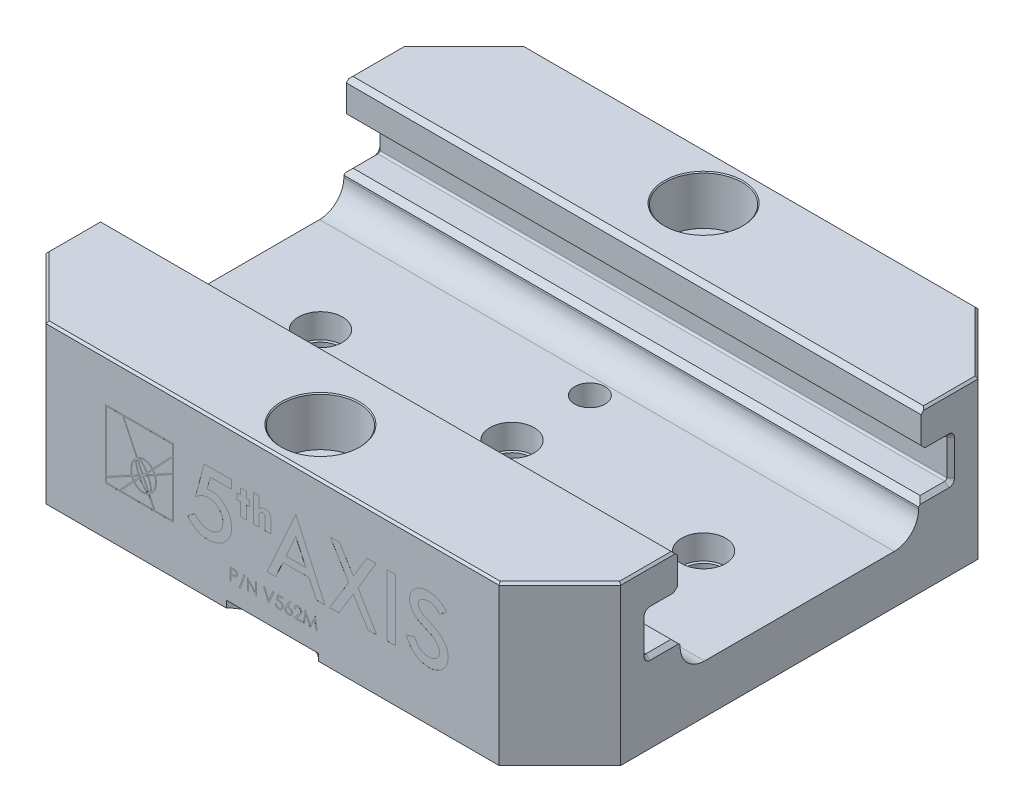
from build123d import *

# Parameters (mm, degrees)
SKETCH1_W                                         = 150
SKETCH1_H                                         = 125
BOSS_EXTRUDE1_DEPTH                               = 41.275
CUT_EXTRUDE2_INTERIOR_CUT_DEPTH                   = 106.994696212
CUT_EXTRUDE2_INTERIOR_CUT_DEPTH_BACK              = 106.994696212
CBORE_FOR_M12_SHCS1_AT_2_COUNT                    = 2
CBORE_FOR_M12_SHCS1_AT_2_PITCH                    = 100
FILLET1_R                                         = 6.35
CBORE_FOR_5_16_SOCKET_HEAD_CAP_SCREW1_D           = 7.9375
CBORE_FOR_5_16_SOCKET_HEAD_CAP_SCREW1_CBORE_D     = 13.49502
CBORE_FOR_5_16_SOCKET_HEAD_CAP_SCREW1_CBORE_DEPTH = 6.096
CHAMFER1_SIZE                                     = 15.875
SKETCH13_R                                        = 5.00635
CUT_EXTRUDE7_CENTER_LOCATING_BORE_DEPTH           = 7.62
SKETCH16_R                                        = 5.00635
CUT_EXTRUDE8_CLOCKING_BORE_DEPTH                  = 7.62
F_1_2_20_TAPPED_HOLE2_D                           = 11.50874
F_1_2_20_TAPPED_HOLE2_DEPTH                       = 6.35
CHAMFER3_SIZE                                     = 1.397
FILLET3_R                                         = 0.508
CHAMFER4_SIZE                                     = 0.5334
CUT_EXTRUDE9_PRY_SLOTS_DEPTH                      = 1.778
CHAMFER5_SIZE                                     = 2.032
CHAMFER6_SIZE                                     = 1.1684
CHAMFER7_SIZE                                     = 1.016
SKETCH37_W                                        = 17.749232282
SKETCH37_H                                        = 17.749232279
CUT_EXTRUDE1_DEPTH                                = 0.00254
SKETCH38_W                                        = 17.749232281
SKETCH38_H                                        = 17.749232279
CUT_EXTRUDE2_DEPTH                                = 0.00254
CUT_EXTRUDE3_DEPTH                                = 0.00254
CUT_EXTRUDE4_DEPTH                                = 0.00254


with BuildPart() as part:
    # Sketch1 → Boss-Extrude1 (new body)
    with BuildSketch(Plane(origin=(0, 0, 0), x_dir=(1, 0, 0), z_dir=(0, 1, 0))):
        Rectangle(SKETCH1_W, SKETCH1_H)
    extrude(amount=BOSS_EXTRUDE1_DEPTH)

    # Sketch4 → Cut-Extrude2 INTERIOR CUT (cut, two sides: drawn at the far end of the back side and taken through both)
    with BuildSketch(Plane(origin=(0, 0, 0), x_dir=(0, 0, -1), z_dir=(1, 0, 0)).offset(-CUT_EXTRUDE2_INTERIOR_CUT_DEPTH_BACK)):
        Polygon((-31.75, 41.275), (31.75, 41.275), (31.75, 31.115), (39.497, 31.115), (39.497, 20.955), (31.115, 20.955), (31.115, 12.7), (-31.115, 12.7), (-31.115, 20.955), (-39.497, 20.955), (-39.497, 31.115), (-31.75, 31.115), align=None)
    extrude(amount=CUT_EXTRUDE2_INTERIOR_CUT_DEPTH + CUT_EXTRUDE2_INTERIOR_CUT_DEPTH_BACK, mode=Mode.SUBTRACT)

    # Sketch10 → CBORE for M12 SHCS1 (revolve, cut)
    with BuildSketch(Plane(origin=(0, 41.275, -50), x_dir=(0, 0, 1), z_dir=(1, 0, 0))):
        Polygon((0, 0), (0, 41.275), (6.5, 41.275), (6.5, 12.762), (10, 12.762), (10, 0.25), (10.25, 0), align=None)
    cbore_for_m12_shcs1 = revolve(axis=Axis((0, 47.625, -50), (0, -1, 0)), mode=Mode.SUBTRACT)

    # CBORE for M12 SHCS1 at 2: CBORE for M12 SHCS1 ×2
    with Locations(*[(0, 0, i * CBORE_FOR_M12_SHCS1_AT_2_PITCH) for i in range(1, CBORE_FOR_M12_SHCS1_AT_2_COUNT)]):
        add(cbore_for_m12_shcs1, mode=Mode.SUBTRACT)

    # Fillet1
    fillet1_edges = [part.edges().sort_by_distance(p)[0] for p in [
        (0, 12.7, -31.115),
        (0, 12.7, 31.115),
    ]]
    fillet(fillet1_edges, radius=FILLET1_R)

    # CBORE for 5_16 Socket Head Cap Screw1 (through all)
    with Locations(Plane.XZ):
        with Locations((0, -20.32), (0, 20.32)):
            CounterBoreHole(CBORE_FOR_5_16_SOCKET_HEAD_CAP_SCREW1_D / 2, CBORE_FOR_5_16_SOCKET_HEAD_CAP_SCREW1_CBORE_D / 2, CBORE_FOR_5_16_SOCKET_HEAD_CAP_SCREW1_CBORE_DEPTH)

    # Chamfer1
    chamfer1_edges = [part.edges().sort_by_distance(p)[0] for p in [
        (75, 20.6375, 62.5),
        (-75, 20.6375, 62.5),
        (-75, 20.6375, -62.5),
        (75, 20.6375, -62.5),
    ]]
    chamfer(chamfer1_edges, length=CHAMFER1_SIZE)

    # Sketch13 → Cut-Extrude7 CENTER LOCATING BORE (cut)
    with BuildSketch(Plane.XZ):
        with Locations(Location((0, 0, 0), (0, 0, 270))):
            Circle(SKETCH13_R)
    extrude(amount=-CUT_EXTRUDE7_CENTER_LOCATING_BORE_DEPTH, mode=Mode.SUBTRACT)

    # Sketch16 → Cut-Extrude8 CLOCKING BORE (cut)
    with BuildSketch(Plane.XZ):
        with Locations(Location((-50, 0, 0), (0, 0, 270))):
            Circle(SKETCH16_R)
        with Locations(Location((50, 0, 0), (0, 0, 270))):
            Circle(SKETCH16_R)
    extrude(amount=-CUT_EXTRUDE8_CLOCKING_BORE_DEPTH, mode=Mode.SUBTRACT)

    # 1_2-20 Tapped Hole2
    with Locations(Plane(origin=(0, 12.7, 0), x_dir=(1, 0, 0), z_dir=(0, 1, 0))):
        with Locations((50, 0), (0, 0), (-50, 0)):
            Hole(F_1_2_20_TAPPED_HOLE2_D / 2, depth=F_1_2_20_TAPPED_HOLE2_DEPTH)

    # Chamfer3
    chamfer3_edges = [part.edges().sort_by_distance(p)[0] for p in [
        (0, 20.955, -31.115),
        (0, 20.955, 31.115),
    ]]
    chamfer(chamfer3_edges, length=CHAMFER3_SIZE)

    # Fillet3
    fillet3_edges = [part.edges().sort_by_distance(p)[0] for p in [
        (0, 31.115, -39.497),
        (0, 20.955, -39.497),
        (0, 20.955, 39.497),
        (0, 31.115, 39.497),
    ]]
    fillet(fillet3_edges, radius=FILLET3_R)

    # Chamfer4
    chamfer4_edges = [part.edges().sort_by_distance(p)[0] for p in [
        (0, 41.275, -62.5),
        (67.0625, 41.275, -54.5625),
        (-67.0625, 41.275, -54.5625),
        (0, 41.275, 62.5),
        (75, 41.275, 39.1875),
        (67.0625, 41.275, 54.5625),
        (-67.0625, 41.275, 54.5625),
        (75, 41.275, -39.1875),
        (-75, 41.275, 39.1875),
        (-75, 41.275, -39.1875),
    ]]
    chamfer(chamfer4_edges, length=CHAMFER4_SIZE)

    # Sketch20 → Cut-Extrude9 PRY SLOTS (cut)
    with BuildSketch(Plane.XZ):
        with BuildLine():
            Line((-6.35, 75.2), (6.35, 75.2))
            ThreePointArc((6.35, 75.2), (13.97, 67.58), (6.35, 59.96))
            Line((6.35, 59.96), (-6.35, 59.96))
            ThreePointArc((-6.35, 59.96), (-13.97, 67.58), (-6.35, 75.2))
        make_face()
        with BuildLine():
            Line((-6.35, -75.2), (6.35, -75.2))
            ThreePointArc((6.35, -75.2), (13.97, -67.58), (6.35, -59.96))
            Line((6.35, -59.96), (-6.35, -59.96))
            ThreePointArc((-6.35, -59.96), (-13.97, -67.58), (-6.35, -75.2))
        make_face()
    extrude(amount=-CUT_EXTRUDE9_PRY_SLOTS_DEPTH, mode=Mode.SUBTRACT)

    # Chamfer5
    chamfer5_edges = [part.edges().sort_by_distance(p)[0] for p in [
        (0, 31.115, 31.75),
        (0, 31.115, -31.75),
    ]]
    chamfer(chamfer5_edges, length=CHAMFER5_SIZE)

    # Chamfer6
    chamfer6_edges = [part.edges().sort_by_distance(p)[0] for p in [
        (0, 41.275, -31.75),
        (0, 41.275, 31.75),
    ]]
    chamfer(chamfer6_edges, length=CHAMFER6_SIZE)

    # Chamfer7
    chamfer7_edges = [part.edges().sort_by_distance(p)[0] for p in [
        (-75, 20.955, -35.7505),
        (75, 20.955, -35.7505),
        (-75, 31.115, -36.3855),
        (75, 31.115, -36.3855),
        (-75, 26.035, -39.497),
        (75, 26.035, -39.497),
        (-75, 26.035, 39.497),
        (75, 26.035, 39.497),
        (75, 20.955, 35.7505),
        (-75, 20.955, 35.7505),
        (75, 30.966210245, -39.348210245),
        (-75, 30.966210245, -39.348210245),
        (75, 21.103789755, -39.348210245),
        (-75, 21.103789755, -39.348210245),
        (75, 30.966210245, 39.348210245),
        (-75, 30.966210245, 39.348210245),
        (75, 21.103789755, 39.348210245),
        (-75, 21.103789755, 39.348210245),
        (75, 31.115, 36.3855),
        (-75, 31.115, 36.3855),
    ]]
    chamfer(chamfer7_edges, length=CHAMFER7_SIZE)

    # Sketch37 → Cut-Extrude1 (cut)
    # profile 1 of 8: a face of its own
    with BuildSketch(Plane(origin=(0, 0, -62.5), x_dir=(-1, 0, 0), z_dir=(0, 0, -1))):
        with BuildLine():
            Line((31.58179712, 30.329033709), (29.46480205, 30.329033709))
            add(Edge.make_bspline(
                [(29.46480205, 30.329033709), (29.425902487, 30.322971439), (29.429059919, 30.277757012), (29.431459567, 30.231721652)],
                knots=[4, 4, 4, 4, 5, 5, 5, 5], degree=3))
            Line((29.431459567, 30.231721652), (29.431459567, 14.273112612))
            add(Edge.make_bspline(
                [(29.431459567, 14.273112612), (30.081764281, 14.209585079), (30.927450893, 14.230676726), (31.58179712, 14.273112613)],
                knots=[2, 2, 2, 2, 3, 3, 3, 3], degree=3))
            Line((31.58179712, 14.273112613), (31.58179712, 30.329033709))
        make_face()
    # profile 2 of 8: a face of its own
    with BuildSketch(Plane(origin=(0, 0, -62.5), x_dir=(-1, 0, 0), z_dir=(0, 0, -1))):
        with BuildLine():
            Line((26.565521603, 30.329033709), (24.155516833, 30.329033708))
            add(Edge.make_bspline(
                [(24.155516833, 30.329033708), (22.953671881, 28.404515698), (21.801082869, 26.429289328), (20.60555278, 24.499466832)],
                knots=[2, 2, 2, 2, 3, 3, 3, 3], degree=3))
            add(Edge.make_bspline(
                [(20.60555278, 24.499466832), (19.336391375, 26.39013717), (18.227753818, 28.439942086), (16.957076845, 30.329033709)],
                knots=[1, 1, 1, 1, 2, 2, 2, 2], degree=3))
            add(Edge.make_bspline(
                [(16.957076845, 30.329033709), (16.175801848, 30.308005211), (15.307255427, 30.372101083), (14.580540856, 30.296575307)],
                knots=[0, 0, 0, 0, 1, 1, 1, 1], degree=3))
            add(Edge.make_bspline(
                [(14.580540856, 30.296575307), (16.203082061, 27.707228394), (17.776114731, 25.068814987), (19.368218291, 22.447956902)],
                knots=[11, 11, 11, 11, 12, 12, 12, 12], degree=3))
            add(Edge.make_bspline(
                [(19.368218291, 22.447956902), (17.724838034, 19.70376952), (16.043442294, 16.999618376), (14.416354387, 14.239643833)],
                knots=[10, 10, 10, 10, 11, 11, 11, 11], degree=3))
            add(Edge.make_bspline(
                [(14.416354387, 14.239643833), (14.991638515, 14.248863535), (16.015151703, 14.233707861), (16.794658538, 14.239643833)],
                knots=[9, 9, 9, 9, 10, 10, 10, 10], degree=3))
            add(Edge.make_bspline(
                [(16.794658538, 14.239643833), (18.126968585, 16.241708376), (19.307974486, 18.3934352), (20.60555278, 20.428210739)],
                knots=[8, 8, 8, 8, 9, 9, 9, 9], degree=3))
            add(Edge.make_bspline(
                [(20.60555278, 20.428210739), (21.833162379, 18.354914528), (23.070244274, 16.292100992), (24.318692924, 14.239643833)],
                knots=[7, 7, 7, 7, 8, 8, 8, 8], degree=3))
            Line((24.318692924, 14.239643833), (26.695860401, 14.239643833))
            add(Edge.make_bspline(
                [(26.695860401, 14.239643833), (25.113734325, 17.022983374), (23.426276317, 19.700106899), (21.81030257, 22.447956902)],
                knots=[5, 5, 5, 5, 6, 6, 6, 6], degree=3))
            add(Edge.make_bspline(
                [(21.81030257, 22.447956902), (23.393817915, 25.075571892), (25.006760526, 27.676348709), (26.565521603, 30.329033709)],
                knots=[4, 4, 4, 4, 5, 5, 5, 5], degree=3))
        make_face()
    # profile 3 of 8: a face of its own
    with BuildSketch(Plane(origin=(0, 0, -62.5), x_dir=(-1, 0, 0), z_dir=(0, 0, -1))):
        with BuildLine():
            Line((9.010325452, 18.375879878), (10.931559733, 14.273112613))
            add(Edge.make_bspline(
                [(10.931559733, 14.273112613), (11.607250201, 14.198092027), (12.418457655, 14.260988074), (13.14681409, 14.239643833)],
                knots=[1, 1, 1, 1, 2, 2, 2, 2], degree=3))
            add(Edge.make_bspline(
                [(13.14681409, 14.239643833), (10.654589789, 19.835244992), (8.139631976, 25.408744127), (5.557484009, 30.915242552)],
                knots=[0, 0, 0, 0, 1, 1, 1, 1], degree=3))
            add(Edge.make_bspline(
                [(5.557484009, 30.915242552), (3.103527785, 25.336438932), (0.550428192, 19.855705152), (-1.899739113, 14.273112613)],
                knots=[7, 7, 7, 7, 8, 8, 8, 8], degree=3))
            add(Edge.make_bspline(
                [(-1.899739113, 14.273112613), (-1.329506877, 14.203775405), (-0.381519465, 14.256315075), (0.346710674, 14.239643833)],
                knots=[6, 6, 6, 6, 7, 7, 7, 7], degree=3))
            add(Edge.make_bspline(
                [(0.346710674, 14.239643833), (0.977944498, 15.616663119), (1.549818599, 17.054178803), (2.236370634, 18.375879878)],
                knots=[5, 5, 5, 5, 6, 6, 6, 6], degree=3))
            Line((2.236370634, 18.375879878), (9.010325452, 18.375879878))
        make_face()
        with BuildLine():
            Line((3.01815082, 20.200244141), (8.164259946, 20.200244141))
            add(Edge.make_bspline(
                [(8.164259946, 20.200244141), (7.313774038, 22.119583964), (6.480717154, 24.053953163), (5.557484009, 25.899977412)],
                knots=[1, 1, 1, 1, 2, 2, 2, 2], degree=3))
            add(Edge.make_bspline(
                [(5.557484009, 25.899977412), (4.725942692, 23.984994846), (3.852723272, 22.111122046), (3.01815082, 20.200244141)],
                knots=[2, 2, 2, 2, 3, 3, 3, 3], degree=3))
        make_face(mode=Mode.SUBTRACT)
    # profile 4 of 8: a face of its own
    with BuildSketch(Plane(origin=(0, 0, -62.5), x_dir=(-1, 0, 0), z_dir=(0, 0, -1))):
        with BuildLine():
            Line((-3.999260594, 23.230236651), (-3.999260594, 26.070821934))
            add(Edge.make_bspline(
                [(-3.999260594, 26.070821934), (-3.985948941, 26.194637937), (-3.921817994, 26.450205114), (-3.671803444, 26.820765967), (-3.184537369, 27.019979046), (-2.645899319, 26.870579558), (-2.463216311, 26.520491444), (-2.412538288, 26.331146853), (-2.40114347, 26.277379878)],
                knots=[0.032272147, 0.032272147, 0.032272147, 0.032272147, 0.137843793, 0.245999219, 0.399968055, 0.550550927, 0.668356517, 0.714575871, 0.714575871, 0.714575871, 0.714575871], degree=3))
            Line((-2.40114347, 26.277379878), (-2.40114347, 23.230236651))
            Line((-2.40114347, 23.230236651), (-0.883346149, 23.230236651))
            Line((-0.883346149, 23.230236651), (-0.883346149, 25.958302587))
            add(Edge.make_bspline(
                [(-0.883346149, 25.958302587), (-0.856026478, 26.398021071), (-0.923074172, 27.139536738), (-1.646812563, 28.240677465), (-3.042888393, 28.250106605), (-3.837502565, 27.632526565), (-3.999260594, 27.27365428)],
                knots=[0.003707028, 0.003707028, 0.003707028, 0.003707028, 0.272214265, 0.45169811, 0.75129312, 1, 1, 1, 1], degree=3))
            Line((-3.999260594, 27.27365428), (-3.999260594, 30.362502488))
            Line((-3.999260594, 30.362502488), (-5.517057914, 30.362502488))
            Line((-5.517057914, 30.362502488), (-5.517057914, 23.230236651))
            Line((-5.517057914, 23.230236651), (-3.999260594, 23.230236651))
        make_face()
    # profile 5 of 8: a face of its own
    with BuildSketch(Plane(origin=(0, 0, -62.5), x_dir=(-1, 0, 0), z_dir=(0, 0, -1))):
        Polygon((-7.344802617, 26.581143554), (-6.484407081, 26.581143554), (-6.484407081, 28.064261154), (-7.344802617, 28.064261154), (-7.344802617, 29.712074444), (-8.862599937, 29.712074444), (-8.862599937, 28.064261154), (-9.722995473, 28.064261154), (-9.722995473, 26.581143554), (-8.862599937, 26.581143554), (-8.862599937, 23.230236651), (-7.344802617, 23.230236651), align=None)
    # profile 6 of 8: a face of its own
    with BuildSketch(Plane(origin=(0, 0, -62.5), x_dir=(-1, 0, 0), z_dir=(0, 0, -1))):
        with Locations((-35.19896006, 22.040626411)):
            Rectangle(SKETCH37_W, SKETCH37_H)
        with BuildLine():
            Line((-36.671318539, 17.096211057), (-40.168902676, 13.414930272))
            Line((-40.168902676, 13.414930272), (-31.450691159, 13.414930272))
            Line((-31.450691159, 13.414930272), (-32.780608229, 16.224614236))
            add(Edge.make_bspline(
                [(-32.780608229, 16.224614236), (-32.90466314, 16.156481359), (-33.447177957, 15.903198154), (-34.48909657, 15.748747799), (-35.746460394, 16.161061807), (-36.411516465, 16.75868705), (-36.671318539, 17.096211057)],
                knots=[2.395897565, 2.395897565, 2.395897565, 2.395897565, 2.51666477, 2.909363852, 3.302062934, 3.655058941, 3.655058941, 3.655058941, 3.655058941], degree=3))
        make_face(mode=Mode.SUBTRACT)
        with BuildLine():
            Line((-39.616350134, 30.666322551), (-43.824656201, 30.666322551))
            Line((-43.824656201, 30.666322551), (-43.824656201, 14.825155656))
            Line((-43.824656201, 14.825155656), (-37.303432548, 18.335747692))
            add(Edge.make_bspline(
                [(-37.303432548, 18.335747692), (-37.470976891, 18.876196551), (-37.652015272, 20.485516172), (-36.898837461, 22.166241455), (-36.085160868, 22.888197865), (-35.975483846, 22.974351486)],
                knots=[0.668662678, 0.668662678, 0.668662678, 0.668662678, 1.116581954, 1.901980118, 2.018715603, 2.018715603, 2.018715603, 2.018715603], degree=3))
            Line((-35.975483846, 22.974351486), (-39.616350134, 30.666322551))
        make_face(mode=Mode.SUBTRACT)
        with BuildLine():
            Line((-37.083507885, 18.454140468), (-35.501067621, 19.306020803))
            add(Edge.make_bspline(
                [(-35.501067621, 19.306020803), (-35.670103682, 19.673383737), (-35.986047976, 20.479417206), (-36.207257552, 21.424122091), (-36.247391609, 22.057714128), (-36.225163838, 22.317263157), (-36.206706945, 22.423287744)],
                knots=[0.436793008, 0.436793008, 0.436793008, 0.436793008, 0.777426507, 1.170125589, 1.36647513, 1.518730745, 1.518730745, 1.518730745, 1.518730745], degree=3))
            add(Edge.make_bspline(
                [(-36.206706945, 22.423287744), (-37.76642158, 20.747439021), (-37.083507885, 18.454140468)],
                knots=[0.824188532, 0.824188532, 0.824188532, 2.005071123, 2.005071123, 2.005071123], degree=2, weights=[1, 0.830695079, 1]))
        make_face(mode=Mode.SUBTRACT)
        with BuildLine():
            Line((-35.659642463, 22.888904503), (-34.280109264, 19.974397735))
            Line((-34.280109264, 19.974397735), (-33.423883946, 20.875592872))
            add(Edge.make_bspline(
                [(-33.423883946, 20.875592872), (-34.803540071, 23.301193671), (-35.659642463, 22.888904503)],
                knots=[4.914311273, 4.914311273, 4.914311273, 6.283185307, 6.283185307, 6.283185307], degree=2, weights=[1, 0.774775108, 1]))
        make_face(mode=Mode.SUBTRACT)
        with BuildLine():
            Line((-37.221714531, 18.097042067), (-43.824656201, 14.542458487))
            Line((-43.824656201, 14.542458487), (-43.824656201, 13.414930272))
            Line((-43.824656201, 13.414930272), (-40.512257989, 13.414930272))
            Line((-40.512257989, 13.414930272), (-36.818698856, 17.302478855))
            add(Edge.make_bspline(
                [(-36.818698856, 17.302478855), (-36.980538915, 17.546750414), (-37.115541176, 17.814384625), (-37.221714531, 18.097042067)],
                knots=[2.085522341, 2.085522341, 2.085522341, 2.085522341, 2.326166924, 2.326166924, 2.326166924, 2.326166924], degree=3))
        make_face(mode=Mode.SUBTRACT)
        with BuildLine():
            Line((-36.642805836, 17.487609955), (-35.302668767, 18.898132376))
            add(Edge.make_bspline(
                [(-35.302668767, 18.898132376), (-35.333732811, 18.958659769), (-35.364267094, 19.019593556), (-35.394220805, 19.080842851)],
                knots=[1.588657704, 1.588657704, 1.588657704, 1.588657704, 1.646034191, 1.646034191, 1.646034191, 1.646034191], degree=3))
            Line((-35.394220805, 19.080842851), (-37.003727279, 18.21439187))
            add(Edge.make_bspline(
                [(-37.003727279, 18.21439187), (-36.860062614, 17.824856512), (-36.642805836, 17.487609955)],
                knots=[2.076152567, 2.076152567, 2.076152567, 2.309670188, 2.309670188, 2.309670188], degree=2, weights=[1, 0.99319143, 1]))
        make_face(mode=Mode.SUBTRACT)
        with BuildLine():
            Line((-26.573263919, 23.82945795), (-31.075575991, 21.405713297))
            add(Edge.make_bspline(
                [(-31.075575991, 21.405713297), (-30.84847681, 20.801124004), (-30.608004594, 19.100409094), (-31.445506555, 17.231513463), (-32.366987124, 16.483069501), (-32.566100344, 16.353252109)],
                knots=[3.725913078, 3.725913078, 3.725913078, 3.725913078, 4.240639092, 5.026037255, 5.227114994, 5.227114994, 5.227114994, 5.227114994], degree=3))
            Line((-32.566100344, 16.353252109), (-31.175294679, 13.414930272))
            Line((-31.175294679, 13.414930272), (-26.573263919, 13.414930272))
            Line((-26.573263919, 13.414930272), (-26.573263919, 23.82945795))
        make_face(mode=Mode.SUBTRACT)
        with BuildLine():
            Line((-26.573263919, 30.666322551), (-39.340953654, 30.666322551))
            Line((-39.340953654, 30.666322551), (-35.770632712, 23.123390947))
            add(Edge.make_bspline(
                [(-35.770632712, 23.123390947), (-35.56922914, 23.258767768), (-34.946905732, 23.585208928), (-34.259723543, 23.687074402), (-33.81708939, 23.64942531), (-33.374455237, 23.611776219), (-32.627685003, 23.366895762), (-32.011271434, 22.852748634), (-31.785874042, 22.599632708)],
                knots=[5.607073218, 5.607073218, 5.607073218, 5.607073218, 5.812022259, 6.20472134, 6.20472134, 6.20472134, 6.597420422, 6.880833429, 6.880833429, 6.880833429, 6.880833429], degree=3))
            Line((-31.785874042, 22.599632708), (-26.573263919, 28.086014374))
            Line((-26.573263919, 28.086014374), (-26.573263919, 30.666322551))
        make_face(mode=Mode.SUBTRACT)
        with BuildLine():
            Line((-26.573263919, 24.112155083), (-26.573263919, 27.724625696))
            Line((-26.573263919, 27.724625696), (-31.625971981, 22.406544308))
            add(Edge.make_bspline(
                [(-31.625971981, 22.406544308), (-31.596750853, 22.368581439), (-31.421717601, 22.13139684), (-31.273935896, 21.869201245), (-31.170542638, 21.63728673)],
                knots=[5.293867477, 5.293867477, 5.293867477, 5.293867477, 5.333570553, 5.53749022, 5.53749022, 5.53749022, 5.53749022], degree=3))
            Line((-31.170542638, 21.63728673), (-26.573263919, 24.112155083))
        make_face(mode=Mode.SUBTRACT)
        with BuildLine():
            Line((-33.245012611, 21.063858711), (-31.958243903, 22.418209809))
            add(Edge.make_bspline(
                [(-31.958243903, 22.418209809), (-33.368622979, 24.022432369), (-35.232483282, 23.143593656)],
                knots=[5.600787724, 5.600787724, 5.600787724, 6.739647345, 6.739647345, 6.739647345], degree=2, weights=[1, 0.842208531, 1]))
            add(Edge.make_bspline(
                [(-35.232483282, 23.143593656), (-35.166853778, 23.125022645), (-34.980210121, 23.051786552), (-34.671311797, 22.855572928), (-34.172986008, 22.40380411), (-33.683002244, 21.782286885), (-33.343739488, 21.234461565), (-33.245012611, 21.063858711)],
                knots=[4.935800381, 4.935800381, 4.935800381, 4.935800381, 5.041108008, 5.237457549, 5.433807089, 5.826506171, 5.995793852, 5.995793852, 5.995793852, 5.995793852], degree=3))
        make_face(mode=Mode.SUBTRACT)
        with BuildLine():
            Line((-35.281463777, 19.424240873), (-34.495396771, 19.847406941))
            Line((-34.495396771, 19.847406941), (-35.849321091, 22.707810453))
            add(Edge.make_bspline(
                [(-35.849321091, 22.707810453), (-36.381334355, 21.823165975), (-35.281463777, 19.424240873)],
                knots=[0.215914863, 0.215914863, 0.215914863, 1.514258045, 1.514258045, 1.514258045], degree=2, weights=[1, 0.796584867, 1]))
        make_face(mode=Mode.SUBTRACT)
        with BuildLine():
            Line((-35.179856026, 18.666006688), (-36.497487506, 17.279171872))
            add(Edge.make_bspline(
                [(-36.497487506, 17.279171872), (-35.085943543, 15.406164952), (-33.06480724, 16.35916171)],
                knots=[2.384432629, 2.384432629, 2.384432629, 3.598054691, 3.598054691, 3.598054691], degree=2, weights=[1, 0.821470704, 1]))
            add(Edge.make_bspline(
                [(-33.06480724, 16.35916171), (-33.130436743, 16.377732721), (-33.317080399, 16.450968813), (-33.625978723, 16.647182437), (-34.124304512, 17.098951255), (-34.662181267, 17.781218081), (-35.042629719, 18.414321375), (-35.179856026, 18.666006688)],
                knots=[1.720084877, 1.720084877, 1.720084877, 1.720084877, 1.825392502, 2.021742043, 2.218091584, 2.610790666, 2.854201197, 2.854201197, 2.854201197, 2.854201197], degree=3))
        make_face(mode=Mode.SUBTRACT)
        with BuildLine():
            Line((-35.120749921, 19.089605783), (-34.851479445, 19.373018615))
            Line((-34.851479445, 19.373018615), (-35.174872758, 19.198925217))
            add(Edge.make_bspline(
                [(-35.174872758, 19.198925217), (-35.148118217, 19.144079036), (-35.120749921, 19.089605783)],
                knots=[1.585862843, 1.585862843, 1.585862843, 1.620909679, 1.620909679, 1.620909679], degree=2, weights=[1, 0.999846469, 1]))
        make_face(mode=Mode.SUBTRACT)
        with BuildLine():
            Line((-32.952707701, 16.58820467), (-34.349752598, 19.539707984))
            Line((-34.349752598, 19.539707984), (-34.999528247, 18.855805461))
            add(Edge.make_bspline(
                [(-34.999528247, 18.855805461), (-33.897313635, 16.795059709), (-32.952707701, 16.58820467)],
                knots=[1.69681415, 1.69681415, 1.69681415, 2.88547204, 2.88547204, 2.88547204], degree=2, weights=[1, 0.828524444, 1]))
        make_face(mode=Mode.SUBTRACT)
        with BuildLine():
            Line((-34.169286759, 19.740265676), (-32.681038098, 16.596078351))
            add(Edge.make_bspline(
                [(-32.681038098, 16.596078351), (-31.508984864, 16.996330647), (-33.122417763, 20.303830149)],
                knots=[3.101386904, 3.101386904, 3.101386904, 4.727455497, 4.727455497, 4.727455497], degree=2, weights=[1, 0.68729756, 1]))
            Line((-33.122417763, 20.303830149), (-34.169286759, 19.740265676))
        make_face(mode=Mode.SUBTRACT)
        with BuildLine():
            Line((-33.297762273, 20.646949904), (-33.598851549, 20.330047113))
            Line((-33.598851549, 20.330047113), (-33.234268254, 20.526314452))
            add(Edge.make_bspline(
                [(-33.234268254, 20.526314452), (-33.265673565, 20.586955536), (-33.297762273, 20.646949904)],
                knots=[4.799060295, 4.799060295, 4.799060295, 4.838406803, 4.838406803, 4.838406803], degree=2, weights=[1, 0.999806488, 1]))
        make_face(mode=Mode.SUBTRACT)
        with BuildLine():
            Line((-33.015092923, 20.644303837), (-31.387763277, 21.520349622))
            add(Edge.make_bspline(
                [(-31.387763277, 21.520349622), (-31.557507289, 21.902076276), (-31.799803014, 22.223583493)],
                knots=[5.288826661, 5.288826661, 5.288826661, 5.526025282, 5.526025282, 5.526025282], degree=2, weights=[1, 0.992975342, 1]))
            Line((-31.799803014, 22.223583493), (-33.117434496, 20.836748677))
            add(Edge.make_bspline(
                [(-33.117434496, 20.836748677), (-33.082766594, 20.773164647), (-33.048631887, 20.70897907), (-33.015092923, 20.644303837)],
                knots=[4.800183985, 4.800183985, 4.800183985, 4.800183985, 4.861677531, 4.861677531, 4.861677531, 4.861677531], degree=3))
        make_face(mode=Mode.SUBTRACT)
        with BuildLine():
            Line((-31.293563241, 21.288363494), (-32.903069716, 20.421912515))
            add(Edge.make_bspline(
                [(-32.903069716, 20.421912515), (-32.893745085, 20.402845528), (-32.680702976, 19.963870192), (-32.323631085, 19.076245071), (-32.090032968, 18.078633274), (-32.049898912, 17.445041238), (-32.072126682, 17.18549221), (-32.090583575, 17.079467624)],
                knots=[3.578385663, 3.578385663, 3.578385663, 3.578385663, 3.59624704, 3.988946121, 4.381645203, 4.577994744, 4.730250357, 4.730250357, 4.730250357, 4.730250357], degree=3))
            add(Edge.make_bspline(
                [(-32.090583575, 17.079467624), (-30.408027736, 18.887304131), (-31.293563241, 21.288363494)],
                knots=[3.965781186, 3.965781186, 3.965781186, 5.21774522, 5.21774522, 5.21774522], degree=2, weights=[1, 0.810388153, 1]))
        make_face(mode=Mode.SUBTRACT)
    # profile 7 of 8: a face of its own
    with BuildSketch(Plane(origin=(0, 0, -62.5), x_dir=(-1, 0, 0), z_dir=(0, 0, -1))):
        with BuildLine():
            Line((-11.14975218, 30.36250249), (-18.347813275, 30.36250249))
            add(Edge.make_bspline(
                [(-18.347813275, 30.36250249), (-18.393406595, 30.35321964), (-18.384944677, 30.290576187), (-18.412919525, 30.263990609)],
                knots=[15, 15, 15, 15, 16, 16, 16, 16], degree=3))
            add(Edge.make_bspline(
                [(-18.412919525, 30.263990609), (-19.137992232, 27.471683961), (-19.846519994, 24.662706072), (-20.595020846, 21.893511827)],
                knots=[14, 14, 14, 14, 15, 15, 15, 15], degree=3))
            add(Edge.make_bspline(
                [(-20.595020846, 21.893511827), (-20.467207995, 21.842171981), (-20.372169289, 21.999980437), (-20.301947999, 22.056687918)],
                knots=[13, 13, 13, 13, 14, 14, 14, 14], degree=3))
            add(Edge.make_bspline(
                [(-20.301947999, 22.056687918), (-19.527682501, 22.682932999), (-18.715654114, 23.248618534), (-17.338003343, 23.262069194)],
                knots=[12, 12, 12, 12, 13, 13, 13, 13], degree=3))
            add(Edge.make_bspline(
                [(-17.338003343, 23.262069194), (-15.297923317, 23.281076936), (-13.585332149, 21.910183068), (-13.462571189, 19.874397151)],
                knots=[11, 11, 11, 11, 12, 12, 12, 12], degree=3))
            add(Edge.make_bspline(
                [(-13.462571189, 19.874397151), (-13.331664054, 17.725448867), (-14.861945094, 16.010963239), (-17.305608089, 16.031423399)],
                knots=[10, 10, 10, 10, 11, 11, 11, 11], degree=3))
            add(Edge.make_bspline(
                [(-17.305608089, 16.031423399), (-19.01112661, 16.045694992), (-19.866159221, 16.959708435), (-20.757376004, 17.854524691)],
                knots=[9, 9, 9, 9, 10, 10, 10, 10], degree=3))
            add(Edge.make_bspline(
                [(-20.757376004, 17.854524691), (-21.356593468, 17.390129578), (-22.074656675, 17.043317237), (-22.678926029, 16.585236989)],
                knots=[8, 8, 8, 8, 9, 9, 9, 9], degree=3))
            add(Edge.make_bspline(
                [(-22.678926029, 16.585236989), (-21.442538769, 14.763777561), (-19.002159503, 13.203627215), (-15.840117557, 13.914302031)],
                knots=[7, 7, 7, 7, 8, 8, 8, 8], degree=3))
            add(Edge.make_bspline(
                [(-15.840117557, 13.914302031), (-13.445710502, 14.451949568), (-11.333830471, 16.386950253), (-11.182084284, 19.124696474)],
                knots=[6, 6, 6, 6, 7, 7, 7, 7], degree=3))
            add(Edge.make_bspline(
                [(-11.182084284, 19.124696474), (-11.069616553, 21.172228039), (-11.859037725, 22.635255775), (-12.908883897, 23.68447046)],
                knots=[5, 5, 5, 5, 6, 6, 6, 6], degree=3))
            add(Edge.make_bspline(
                [(-12.908883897, 23.68447046), (-13.970917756, 24.74789359), (-15.478275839, 25.458757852), (-17.566222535, 25.11800778)],
                knots=[4, 4, 4, 4, 5, 5, 5, 5], degree=3))
            add(Edge.make_bspline(
                [(-17.566222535, 25.11800778), (-17.261846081, 26.127059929), (-17.00192627, 27.181705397), (-16.686877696, 28.179327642)],
                knots=[3, 3, 3, 3, 4, 4, 4, 4], degree=3))
            Line((-16.686877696, 28.179327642), (-11.14975218, 28.179327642))
            Line((-11.14975218, 28.179327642), (-11.14975218, 30.36250249))
        make_face()
    # profile 8 of 8: a face of its own
    with BuildSketch(Plane(origin=(0, 0, -62.5), x_dir=(-1, 0, 0), z_dir=(0, 0, -1))):
        with BuildLine():
            add(Edge.make_bspline(
                [(41.579742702, 28.375783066), (42.306962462, 28.090982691), (42.636093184, 27.502563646), (43.175382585, 27.13781709)],
                knots=[0, 0, 0, 0, 1, 1, 1, 1], degree=3))
            add(Edge.make_bspline(
                [(43.175382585, 27.13781709), (43.485821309, 27.352396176), (43.711261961, 27.580425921), (44.055169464, 27.85392269)],
                knots=[19, 19, 19, 19, 20, 20, 20, 20], degree=3))
            add(Edge.make_bspline(
                [(44.055169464, 27.85392269), (44.177172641, 27.951361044), (44.932177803, 28.430911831), (44.933693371, 28.570786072)],
                knots=[18, 18, 18, 18, 19, 19, 19, 19], degree=3))
            add(Edge.make_bspline(
                [(44.933693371, 28.570786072), (44.934703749, 28.606970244), (44.597490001, 28.936227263), (44.511355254, 29.026845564)],
                knots=[17, 17, 17, 17, 18, 18, 18, 18], degree=3))
            add(Edge.make_bspline(
                [(44.511355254, 29.026845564), (43.460056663, 30.111549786), (41.811119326, 30.823803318), (39.983345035, 30.817930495)],
                knots=[16, 16, 16, 16, 17, 17, 17, 17], degree=3))
            add(Edge.make_bspline(
                [(39.983345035, 30.817930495), (38.584097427, 30.813131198), (37.550606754, 30.345641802), (36.824776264, 29.776041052)],
                knots=[15, 15, 15, 15, 16, 16, 16, 16], degree=3))
            add(Edge.make_bspline(
                [(36.824776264, 29.776041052), (36.050447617, 29.167351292), (35.420476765, 28.356270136), (35.294305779, 27.170338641)],
                knots=[14, 14, 14, 14, 15, 15, 15, 15], degree=3))
            add(Edge.make_bspline(
                [(35.294305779, 27.170338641), (35.0654551, 25.041850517), (36.397259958, 23.573328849), (37.867107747, 22.773488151)],
                knots=[13, 13, 13, 13, 14, 14, 14, 14], degree=3))
            add(Edge.make_bspline(
                [(37.867107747, 22.773488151), (39.110757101, 22.096092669), (40.832694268, 21.653357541), (41.872499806, 20.786389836)],
                knots=[12, 12, 12, 12, 13, 13, 13, 13], degree=3))
            add(Edge.make_bspline(
                [(41.872499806, 20.786389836), (42.684717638, 20.110951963), (43.434797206, 18.768159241), (42.850798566, 17.496598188)],
                knots=[11, 11, 11, 11, 12, 12, 12, 12], degree=3))
            add(Edge.make_bspline(
                [(42.850798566, 17.496598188), (42.198599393, 16.079037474), (40.003173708, 15.679053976), (38.583718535, 16.389602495)],
                knots=[10, 10, 10, 10, 11, 11, 11, 11], degree=3))
            add(Edge.make_bspline(
                [(38.583718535, 16.389602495), (37.532798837, 16.916767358), (37.067772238, 17.810573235), (36.596809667, 18.73380638)],
                knots=[9, 9, 9, 9, 10, 10, 10, 10], degree=3))
            add(Edge.make_bspline(
                [(36.596809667, 18.73380638), (35.860622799, 18.537792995), (35.125698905, 18.339253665), (34.414140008, 18.11583377)],
                knots=[8, 8, 8, 8, 9, 9, 9, 9], degree=3))
            add(Edge.make_bspline(
                [(34.414140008, 18.11583377), (35.114584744, 16.243602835), (36.251007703, 14.784616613), (38.127911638, 14.109810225)],
                knots=[7, 7, 7, 7, 8, 8, 8, 8], degree=3))
            add(Edge.make_bspline(
                [(38.127911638, 14.109810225), (39.112272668, 13.755546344), (40.398105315, 13.566858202), (41.514320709, 13.816800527)],
                knots=[6, 6, 6, 6, 7, 7, 7, 7], degree=3))
            add(Edge.make_bspline(
                [(41.514320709, 13.816800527), (43.637756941, 14.292688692), (45.473487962, 16.192452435), (45.32521495, 18.799480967)],
                knots=[5, 5, 5, 5, 6, 6, 6, 6], degree=3))
            add(Edge.make_bspline(
                [(45.32521495, 18.799480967), (45.161028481, 21.684426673), (42.867974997, 23.023619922), (40.667497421, 24.011517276)],
                knots=[4, 4, 4, 4, 5, 5, 5, 5], degree=3))
            add(Edge.make_bspline(
                [(40.667497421, 24.011517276), (39.53157965, 24.520621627), (38.13852061, 25.037430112), (37.703931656, 25.997352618)],
                knots=[3, 3, 3, 3, 4, 4, 4, 4], degree=3))
            add(Edge.make_bspline(
                [(37.703931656, 25.997352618), (37.498824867, 26.450444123), (37.514106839, 26.908208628), (37.671094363, 27.300361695)],
                knots=[2, 2, 2, 2, 3, 3, 3, 3], degree=3))
            add(Edge.make_bspline(
                [(37.671094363, 27.300361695), (38.108588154, 28.391696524), (40.144879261, 28.936921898), (41.579742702, 28.375783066)],
                knots=[1, 1, 1, 1, 2, 2, 2, 2], degree=3))
        make_face()
    extrude(amount=-CUT_EXTRUDE1_DEPTH, mode=Mode.SUBTRACT)

    # Sketch38 → Cut-Extrude2 (cut)
    # profile 1 of 8: a face of its own
    with BuildSketch(Plane.XY.offset(62.5)):
        with BuildLine():
            Line((32.078900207, 29.647739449), (29.961905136, 29.647739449))
            add(Edge.make_bspline(
                [(29.961905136, 29.647739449), (29.923005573, 29.641677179), (29.926163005, 29.596462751), (29.928562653, 29.550427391)],
                knots=[4, 4, 4, 4, 5, 5, 5, 5], degree=3))
            Line((29.928562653, 29.550427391), (29.928562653, 13.591818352))
            add(Edge.make_bspline(
                [(29.928562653, 13.591818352), (30.578867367, 13.528290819), (31.424553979, 13.549382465), (32.078900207, 13.591818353)],
                knots=[2, 2, 2, 2, 3, 3, 3, 3], degree=3))
            Line((32.078900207, 13.591818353), (32.078900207, 29.647739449))
        make_face()
    # profile 2 of 8: a face of its own
    with BuildSketch(Plane.XY.offset(62.5)):
        with BuildLine():
            Line((27.062624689, 29.647739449), (24.652619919, 29.647739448))
            add(Edge.make_bspline(
                [(24.652619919, 29.647739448), (23.450774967, 27.723221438), (22.298185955, 25.747995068), (21.102655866, 23.818172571)],
                knots=[2, 2, 2, 2, 3, 3, 3, 3], degree=3))
            add(Edge.make_bspline(
                [(21.102655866, 23.818172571), (19.833494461, 25.70884291), (18.724856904, 27.758647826), (17.454179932, 29.647739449)],
                knots=[1, 1, 1, 1, 2, 2, 2, 2], degree=3))
            add(Edge.make_bspline(
                [(17.454179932, 29.647739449), (16.672904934, 29.626710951), (15.804358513, 29.690806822), (15.077643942, 29.615281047)],
                knots=[0, 0, 0, 0, 1, 1, 1, 1], degree=3))
            add(Edge.make_bspline(
                [(15.077643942, 29.615281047), (16.700185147, 27.025934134), (18.273217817, 24.387520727), (19.865321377, 21.766662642)],
                knots=[11, 11, 11, 11, 12, 12, 12, 12], degree=3))
            add(Edge.make_bspline(
                [(19.865321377, 21.766662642), (18.22194112, 19.022475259), (16.540545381, 16.318324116), (14.913457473, 13.558349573)],
                knots=[10, 10, 10, 10, 11, 11, 11, 11], degree=3))
            add(Edge.make_bspline(
                [(14.913457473, 13.558349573), (15.488741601, 13.567569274), (16.512254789, 13.5524136), (17.291761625, 13.558349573)],
                knots=[9, 9, 9, 9, 10, 10, 10, 10], degree=3))
            add(Edge.make_bspline(
                [(17.291761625, 13.558349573), (18.624071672, 15.560414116), (19.805077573, 17.71214094), (21.102655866, 19.746916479)],
                knots=[8, 8, 8, 8, 9, 9, 9, 9], degree=3))
            add(Edge.make_bspline(
                [(21.102655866, 19.746916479), (22.330265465, 17.673620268), (23.56734736, 15.610806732), (24.81579601, 13.558349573)],
                knots=[7, 7, 7, 7, 8, 8, 8, 8], degree=3))
            Line((24.81579601, 13.558349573), (27.192963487, 13.558349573))
            add(Edge.make_bspline(
                [(27.192963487, 13.558349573), (25.610837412, 16.341689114), (23.923379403, 19.018812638), (22.307405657, 21.766662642)],
                knots=[5, 5, 5, 5, 6, 6, 6, 6], degree=3))
            add(Edge.make_bspline(
                [(22.307405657, 21.766662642), (23.890921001, 24.394277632), (25.503863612, 26.995054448), (27.062624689, 29.647739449)],
                knots=[4, 4, 4, 4, 5, 5, 5, 5], degree=3))
        make_face()
    # profile 3 of 8: a face of its own
    with BuildSketch(Plane.XY.offset(62.5)):
        with BuildLine():
            Line((9.507428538, 17.694585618), (11.428662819, 13.591818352))
            add(Edge.make_bspline(
                [(11.428662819, 13.591818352), (12.104353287, 13.516797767), (12.915560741, 13.579693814), (13.643917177, 13.558349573)],
                knots=[1, 1, 1, 1, 2, 2, 2, 2], degree=3))
            add(Edge.make_bspline(
                [(13.643917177, 13.558349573), (11.151692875, 19.153950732), (8.636735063, 24.727449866), (6.054587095, 30.233948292)],
                knots=[0, 0, 0, 0, 1, 1, 1, 1], degree=3))
            add(Edge.make_bspline(
                [(6.054587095, 30.233948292), (3.600630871, 24.655144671), (1.047531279, 19.174410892), (-1.402636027, 13.591818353)],
                knots=[7, 7, 7, 7, 8, 8, 8, 8], degree=3))
            add(Edge.make_bspline(
                [(-1.402636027, 13.591818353), (-0.832403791, 13.522481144), (0.115583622, 13.575020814), (0.84381376, 13.558349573)],
                knots=[6, 6, 6, 6, 7, 7, 7, 7], degree=3))
            add(Edge.make_bspline(
                [(0.84381376, 13.558349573), (1.475047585, 14.935368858), (2.046921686, 16.372884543), (2.73347372, 17.694585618)],
                knots=[5, 5, 5, 5, 6, 6, 6, 6], degree=3))
            Line((2.73347372, 17.694585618), (9.507428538, 17.694585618))
        make_face()
        with BuildLine():
            Line((3.515253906, 19.518949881), (8.661363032, 19.518949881))
            add(Edge.make_bspline(
                [(8.661363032, 19.518949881), (7.810877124, 21.438289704), (6.97782024, 23.372658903), (6.054587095, 25.218683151)],
                knots=[1, 1, 1, 1, 2, 2, 2, 2], degree=3))
            add(Edge.make_bspline(
                [(6.054587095, 25.218683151), (5.223045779, 23.303700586), (4.349826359, 21.429827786), (3.515253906, 19.518949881)],
                knots=[2, 2, 2, 2, 3, 3, 3, 3], degree=3))
        make_face(mode=Mode.SUBTRACT)
    # profile 4 of 8: a face of its own
    with BuildSketch(Plane.XY.offset(62.5)):
        with BuildLine():
            Line((-3.502157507, 22.548942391), (-3.502157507, 25.389527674))
            add(Edge.make_bspline(
                [(-3.502157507, 25.389527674), (-3.488845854, 25.513343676), (-3.424714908, 25.768910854), (-3.174700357, 26.139471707), (-2.687434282, 26.338684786), (-2.148796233, 26.189285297), (-1.966113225, 25.839197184), (-1.915435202, 25.649852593), (-1.904040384, 25.596085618)],
                knots=[0.032272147, 0.032272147, 0.032272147, 0.032272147, 0.137843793, 0.245999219, 0.399968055, 0.550550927, 0.668356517, 0.714575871, 0.714575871, 0.714575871, 0.714575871], degree=3))
            Line((-1.904040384, 25.596085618), (-1.904040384, 22.548942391))
            Line((-1.904040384, 22.548942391), (-0.386243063, 22.548942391))
            Line((-0.386243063, 22.548942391), (-0.386243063, 25.277008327))
            add(Edge.make_bspline(
                [(-0.386243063, 25.277008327), (-0.358923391, 25.716726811), (-0.425971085, 26.458242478), (-1.149709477, 27.559383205), (-2.545785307, 27.568812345), (-3.340399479, 26.951232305), (-3.502157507, 26.59236002)],
                knots=[0.003707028, 0.003707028, 0.003707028, 0.003707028, 0.272214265, 0.45169811, 0.75129312, 1, 1, 1, 1], degree=3))
            Line((-3.502157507, 26.59236002), (-3.502157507, 29.681208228))
            Line((-3.502157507, 29.681208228), (-5.019954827, 29.681208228))
            Line((-5.019954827, 29.681208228), (-5.019954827, 22.548942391))
            Line((-5.019954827, 22.548942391), (-3.502157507, 22.548942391))
        make_face()
    # profile 5 of 8: a face of its own
    with BuildSketch(Plane.XY.offset(62.5)):
        Polygon((-6.847699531, 25.899849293), (-5.987303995, 25.899849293), (-5.987303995, 27.382966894), (-6.847699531, 27.382966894), (-6.847699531, 29.030780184), (-8.365496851, 29.030780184), (-8.365496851, 27.382966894), (-9.225892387, 27.382966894), (-9.225892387, 25.899849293), (-8.365496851, 25.899849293), (-8.365496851, 22.548942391), (-6.847699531, 22.548942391), align=None)
    # profile 6 of 8: a face of its own
    with BuildSketch(Plane.XY.offset(62.5)):
        with Locations((-34.701856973, 21.359332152)):
            Rectangle(SKETCH38_W, SKETCH38_H)
        with BuildLine():
            Line((-36.174215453, 16.414916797), (-39.67179959, 12.733636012))
            Line((-39.67179959, 12.733636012), (-30.953588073, 12.733636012))
            Line((-30.953588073, 12.733636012), (-32.283505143, 15.543319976))
            add(Edge.make_bspline(
                [(-32.283505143, 15.543319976), (-32.407560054, 15.475187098), (-32.95007487, 15.221903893), (-33.991993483, 15.067453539), (-35.249357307, 15.479767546), (-35.914413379, 16.077392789), (-36.174215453, 16.414916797)],
                knots=[2.395897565, 2.395897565, 2.395897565, 2.395897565, 2.51666477, 2.909363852, 3.302062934, 3.655058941, 3.655058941, 3.655058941, 3.655058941], degree=3))
        make_face(mode=Mode.SUBTRACT)
        with BuildLine():
            Line((-35.47838076, 22.293057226), (-39.119247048, 29.985028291))
            Line((-39.119247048, 29.985028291), (-43.327553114, 29.985028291))
            Line((-43.327553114, 29.985028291), (-43.327553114, 14.143861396))
            Line((-43.327553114, 14.143861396), (-36.806329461, 17.654453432))
            add(Edge.make_bspline(
                [(-36.806329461, 17.654453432), (-36.973873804, 18.194902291), (-37.154912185, 19.804221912), (-36.401734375, 21.484947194), (-35.588057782, 22.206903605), (-35.47838076, 22.293057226)],
                knots=[0.668662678, 0.668662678, 0.668662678, 0.668662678, 1.116581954, 1.901980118, 2.018715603, 2.018715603, 2.018715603, 2.018715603], degree=3))
        make_face(mode=Mode.SUBTRACT)
        with BuildLine():
            Line((-36.586404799, 17.772846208), (-35.003964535, 18.624726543))
            add(Edge.make_bspline(
                [(-35.003964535, 18.624726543), (-35.173000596, 18.992089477), (-35.48894489, 19.798122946), (-35.710154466, 20.742827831), (-35.750288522, 21.376419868), (-35.728060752, 21.635968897), (-35.709603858, 21.741993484)],
                knots=[0.436793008, 0.436793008, 0.436793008, 0.436793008, 0.777426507, 1.170125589, 1.36647513, 1.518730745, 1.518730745, 1.518730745, 1.518730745], degree=3))
            add(Edge.make_bspline(
                [(-35.709603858, 21.741993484), (-37.269318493, 20.066144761), (-36.586404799, 17.772846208)],
                knots=[0.824188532, 0.824188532, 0.824188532, 2.005071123, 2.005071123, 2.005071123], degree=2, weights=[1, 0.830695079, 1]))
        make_face(mode=Mode.SUBTRACT)
        with BuildLine():
            Line((-35.162539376, 22.207610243), (-33.783006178, 19.293103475))
            Line((-33.783006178, 19.293103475), (-32.92678086, 20.194298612))
            add(Edge.make_bspline(
                [(-32.92678086, 20.194298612), (-34.306436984, 22.61989941), (-35.162539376, 22.207610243)],
                knots=[4.914311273, 4.914311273, 4.914311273, 6.283185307, 6.283185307, 6.283185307], degree=2, weights=[1, 0.774775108, 1]))
        make_face(mode=Mode.SUBTRACT)
        with BuildLine():
            Line((-36.724611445, 17.415747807), (-43.327553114, 13.861164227))
            Line((-43.327553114, 13.861164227), (-43.327553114, 12.733636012))
            Line((-43.327553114, 12.733636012), (-40.015154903, 12.733636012))
            Line((-40.015154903, 12.733636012), (-36.32159577, 16.621184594))
            add(Edge.make_bspline(
                [(-36.32159577, 16.621184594), (-36.483435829, 16.865456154), (-36.618438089, 17.133090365), (-36.724611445, 17.415747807)],
                knots=[2.085522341, 2.085522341, 2.085522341, 2.085522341, 2.326166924, 2.326166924, 2.326166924, 2.326166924], degree=3))
        make_face(mode=Mode.SUBTRACT)
        with BuildLine():
            Line((-36.145702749, 16.806315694), (-34.80556568, 18.216838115))
            add(Edge.make_bspline(
                [(-34.80556568, 18.216838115), (-34.836629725, 18.277365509), (-34.867164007, 18.338299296), (-34.897117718, 18.399548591)],
                knots=[1.588657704, 1.588657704, 1.588657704, 1.588657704, 1.646034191, 1.646034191, 1.646034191, 1.646034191], degree=3))
            Line((-34.897117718, 18.399548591), (-36.506624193, 17.533097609))
            add(Edge.make_bspline(
                [(-36.506624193, 17.533097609), (-36.362959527, 17.143562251), (-36.145702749, 16.806315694)],
                knots=[2.076152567, 2.076152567, 2.076152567, 2.309670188, 2.309670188, 2.309670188], degree=2, weights=[1, 0.99319143, 1]))
        make_face(mode=Mode.SUBTRACT)
        with BuildLine():
            Line((-26.076160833, 23.148163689), (-30.578472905, 20.724419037))
            add(Edge.make_bspline(
                [(-30.578472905, 20.724419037), (-30.351373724, 20.119829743), (-30.110901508, 18.419114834), (-30.948403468, 16.550219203), (-31.869884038, 15.80177524), (-32.068997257, 15.671957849)],
                knots=[3.725913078, 3.725913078, 3.725913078, 3.725913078, 4.240639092, 5.026037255, 5.227114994, 5.227114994, 5.227114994, 5.227114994], degree=3))
            Line((-32.068997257, 15.671957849), (-30.678191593, 12.733636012))
            Line((-30.678191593, 12.733636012), (-26.076160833, 12.733636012))
            Line((-26.076160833, 12.733636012), (-26.076160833, 23.148163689))
        make_face(mode=Mode.SUBTRACT)
        with BuildLine():
            Line((-26.076160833, 29.985028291), (-38.843850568, 29.985028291))
            Line((-38.843850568, 29.985028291), (-35.273529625, 22.442096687))
            add(Edge.make_bspline(
                [(-35.273529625, 22.442096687), (-35.072126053, 22.577473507), (-34.449802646, 22.903914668), (-33.762620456, 23.005780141), (-33.319986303, 22.96813105), (-32.877352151, 22.930481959), (-32.130581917, 22.685601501), (-31.514168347, 22.171454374), (-31.288770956, 21.918338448)],
                knots=[5.607073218, 5.607073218, 5.607073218, 5.607073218, 5.812022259, 6.20472134, 6.20472134, 6.20472134, 6.597420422, 6.880833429, 6.880833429, 6.880833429, 6.880833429], degree=3))
            Line((-31.288770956, 21.918338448), (-26.076160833, 27.404720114))
            Line((-26.076160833, 27.404720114), (-26.076160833, 29.985028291))
        make_face(mode=Mode.SUBTRACT)
        with BuildLine():
            Line((-26.076160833, 23.430860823), (-26.076160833, 27.043331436))
            Line((-26.076160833, 27.043331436), (-31.128868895, 21.725250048))
            add(Edge.make_bspline(
                [(-31.128868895, 21.725250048), (-31.099647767, 21.687287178), (-30.924614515, 21.45010258), (-30.77683281, 21.187906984), (-30.673439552, 20.95599247)],
                knots=[5.293867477, 5.293867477, 5.293867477, 5.293867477, 5.333570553, 5.53749022, 5.53749022, 5.53749022, 5.53749022], degree=3))
            Line((-30.673439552, 20.95599247), (-26.076160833, 23.430860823))
        make_face(mode=Mode.SUBTRACT)
        with BuildLine():
            Line((-32.747909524, 20.382564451), (-31.461140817, 21.736915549))
            add(Edge.make_bspline(
                [(-31.461140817, 21.736915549), (-32.871519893, 23.341138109), (-34.735380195, 22.462299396)],
                knots=[5.600787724, 5.600787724, 5.600787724, 6.739647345, 6.739647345, 6.739647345], degree=2, weights=[1, 0.842208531, 1]))
            add(Edge.make_bspline(
                [(-34.735380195, 22.462299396), (-34.669750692, 22.443728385), (-34.483107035, 22.370492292), (-34.17420871, 22.174278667), (-33.675882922, 21.72250985), (-33.185899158, 21.100992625), (-32.846636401, 20.553167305), (-32.747909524, 20.382564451)],
                knots=[4.935800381, 4.935800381, 4.935800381, 4.935800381, 5.041108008, 5.237457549, 5.433807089, 5.826506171, 5.995793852, 5.995793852, 5.995793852, 5.995793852], degree=3))
        make_face(mode=Mode.SUBTRACT)
        with BuildLine():
            Line((-34.78436069, 18.742946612), (-33.998293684, 19.16611268))
            Line((-33.998293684, 19.16611268), (-35.352218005, 22.026516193))
            add(Edge.make_bspline(
                [(-35.352218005, 22.026516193), (-35.884231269, 21.141871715), (-34.78436069, 18.742946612)],
                knots=[0.215914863, 0.215914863, 0.215914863, 1.514258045, 1.514258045, 1.514258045], degree=2, weights=[1, 0.796584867, 1]))
        make_face(mode=Mode.SUBTRACT)
        with BuildLine():
            Line((-34.68275294, 17.984712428), (-36.000384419, 16.597877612))
            add(Edge.make_bspline(
                [(-36.000384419, 16.597877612), (-34.588840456, 14.724870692), (-32.567704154, 15.67786745)],
                knots=[2.384432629, 2.384432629, 2.384432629, 3.598054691, 3.598054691, 3.598054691], degree=2, weights=[1, 0.821470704, 1]))
            add(Edge.make_bspline(
                [(-32.567704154, 15.67786745), (-32.633333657, 15.696438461), (-32.819977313, 15.769674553), (-33.128875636, 15.965888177), (-33.627201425, 16.417656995), (-34.16507818, 17.09992382), (-34.545526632, 17.733027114), (-34.68275294, 17.984712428)],
                knots=[1.720084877, 1.720084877, 1.720084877, 1.720084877, 1.825392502, 2.021742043, 2.218091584, 2.610790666, 2.854201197, 2.854201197, 2.854201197, 2.854201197], degree=3))
        make_face(mode=Mode.SUBTRACT)
        with BuildLine():
            Line((-34.623646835, 18.408311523), (-34.354376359, 18.691724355))
            Line((-34.354376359, 18.691724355), (-34.677769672, 18.517630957))
            add(Edge.make_bspline(
                [(-34.677769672, 18.517630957), (-34.65101513, 18.462784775), (-34.623646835, 18.408311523)],
                knots=[1.585862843, 1.585862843, 1.585862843, 1.620909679, 1.620909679, 1.620909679], degree=2, weights=[1, 0.999846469, 1]))
        make_face(mode=Mode.SUBTRACT)
        with BuildLine():
            Line((-32.455604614, 15.906910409), (-33.852649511, 18.858413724))
            Line((-33.852649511, 18.858413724), (-34.502425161, 18.174511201))
            add(Edge.make_bspline(
                [(-34.502425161, 18.174511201), (-33.400210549, 16.113765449), (-32.455604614, 15.906910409)],
                knots=[1.69681415, 1.69681415, 1.69681415, 2.88547204, 2.88547204, 2.88547204], degree=2, weights=[1, 0.828524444, 1]))
        make_face(mode=Mode.SUBTRACT)
        with BuildLine():
            Line((-33.672183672, 19.058971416), (-32.183935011, 15.91478409))
            add(Edge.make_bspline(
                [(-32.183935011, 15.91478409), (-31.011881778, 16.315036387), (-32.625314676, 19.622535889)],
                knots=[3.101386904, 3.101386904, 3.101386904, 4.727455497, 4.727455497, 4.727455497], degree=2, weights=[1, 0.68729756, 1]))
            Line((-32.625314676, 19.622535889), (-33.672183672, 19.058971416))
        make_face(mode=Mode.SUBTRACT)
        with BuildLine():
            Line((-32.800659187, 19.965655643), (-33.101748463, 19.648752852))
            Line((-33.101748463, 19.648752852), (-32.737165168, 19.845020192))
            add(Edge.make_bspline(
                [(-32.737165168, 19.845020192), (-32.768570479, 19.905661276), (-32.800659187, 19.965655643)],
                knots=[4.799060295, 4.799060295, 4.799060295, 4.838406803, 4.838406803, 4.838406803], degree=2, weights=[1, 0.999806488, 1]))
        make_face(mode=Mode.SUBTRACT)
        with BuildLine():
            Line((-32.517989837, 19.963009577), (-30.89066019, 20.839055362))
            add(Edge.make_bspline(
                [(-30.89066019, 20.839055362), (-31.060404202, 21.220782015), (-31.302699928, 21.542289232)],
                knots=[5.288826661, 5.288826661, 5.288826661, 5.526025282, 5.526025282, 5.526025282], degree=2, weights=[1, 0.992975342, 1]))
            Line((-31.302699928, 21.542289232), (-32.62033141, 20.155454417))
            add(Edge.make_bspline(
                [(-32.62033141, 20.155454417), (-32.585663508, 20.091870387), (-32.5515288, 20.02768481), (-32.517989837, 19.963009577)],
                knots=[4.800183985, 4.800183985, 4.800183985, 4.800183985, 4.861677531, 4.861677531, 4.861677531, 4.861677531], degree=3))
        make_face(mode=Mode.SUBTRACT)
        with BuildLine():
            Line((-30.796460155, 20.607069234), (-32.405966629, 19.740618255))
            add(Edge.make_bspline(
                [(-32.405966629, 19.740618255), (-32.396641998, 19.721551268), (-32.18359989, 19.282575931), (-31.826527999, 18.39495081), (-31.592929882, 17.397339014), (-31.552795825, 16.763746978), (-31.575023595, 16.50419795), (-31.593480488, 16.398173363)],
                knots=[3.578385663, 3.578385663, 3.578385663, 3.578385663, 3.59624704, 3.988946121, 4.381645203, 4.577994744, 4.730250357, 4.730250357, 4.730250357, 4.730250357], degree=3))
            add(Edge.make_bspline(
                [(-31.593480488, 16.398173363), (-29.910924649, 18.206009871), (-30.796460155, 20.607069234)],
                knots=[3.965781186, 3.965781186, 3.965781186, 5.21774522, 5.21774522, 5.21774522], degree=2, weights=[1, 0.810388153, 1]))
        make_face(mode=Mode.SUBTRACT)
    # profile 7 of 8: a face of its own
    with BuildSketch(Plane.XY.offset(62.5)):
        with BuildLine():
            Line((-10.652649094, 29.68120823), (-17.850710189, 29.68120823))
            add(Edge.make_bspline(
                [(-17.850710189, 29.68120823), (-17.896303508, 29.671925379), (-17.88784159, 29.609281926), (-17.915816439, 29.582696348)],
                knots=[15, 15, 15, 15, 16, 16, 16, 16], degree=3))
            add(Edge.make_bspline(
                [(-17.915816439, 29.582696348), (-18.640889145, 26.790389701), (-19.349416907, 23.981411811), (-20.09791776, 21.212217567)],
                knots=[14, 14, 14, 14, 15, 15, 15, 15], degree=3))
            add(Edge.make_bspline(
                [(-20.09791776, 21.212217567), (-19.970104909, 21.160877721), (-19.875066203, 21.318686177), (-19.804844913, 21.375393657)],
                knots=[13, 13, 13, 13, 14, 14, 14, 14], degree=3))
            add(Edge.make_bspline(
                [(-19.804844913, 21.375393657), (-19.030579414, 22.001638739), (-18.218551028, 22.567324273), (-16.840900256, 22.580774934)],
                knots=[12, 12, 12, 12, 13, 13, 13, 13], degree=3))
            add(Edge.make_bspline(
                [(-16.840900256, 22.580774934), (-14.800820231, 22.599782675), (-13.088229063, 21.228888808), (-12.965468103, 19.19310289)],
                knots=[11, 11, 11, 11, 12, 12, 12, 12], degree=3))
            add(Edge.make_bspline(
                [(-12.965468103, 19.19310289), (-12.834560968, 17.044154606), (-14.364842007, 15.329668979), (-16.808505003, 15.350129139)],
                knots=[10, 10, 10, 10, 11, 11, 11, 11], degree=3))
            add(Edge.make_bspline(
                [(-16.808505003, 15.350129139), (-18.514023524, 15.364400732), (-19.369056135, 16.278414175), (-20.260272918, 17.173230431)],
                knots=[9, 9, 9, 9, 10, 10, 10, 10], degree=3))
            add(Edge.make_bspline(
                [(-20.260272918, 17.173230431), (-20.859490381, 16.708835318), (-21.577553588, 16.362022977), (-22.181822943, 15.903942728)],
                knots=[8, 8, 8, 8, 9, 9, 9, 9], degree=3))
            add(Edge.make_bspline(
                [(-22.181822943, 15.903942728), (-20.945435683, 14.082483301), (-18.505056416, 12.522332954), (-15.34301447, 13.23300777)],
                knots=[7, 7, 7, 7, 8, 8, 8, 8], degree=3))
            add(Edge.make_bspline(
                [(-15.34301447, 13.23300777), (-12.948607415, 13.770655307), (-10.836727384, 15.705655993), (-10.684981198, 18.443402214)],
                knots=[6, 6, 6, 6, 7, 7, 7, 7], degree=3))
            add(Edge.make_bspline(
                [(-10.684981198, 18.443402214), (-10.572513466, 20.490933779), (-11.361934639, 21.953961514), (-12.411780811, 23.0031762)],
                knots=[5, 5, 5, 5, 6, 6, 6, 6], degree=3))
            add(Edge.make_bspline(
                [(-12.411780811, 23.0031762), (-13.47381467, 24.066599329), (-14.981172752, 24.777463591), (-17.069119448, 24.43671352)],
                knots=[4, 4, 4, 4, 5, 5, 5, 5], degree=3))
            add(Edge.make_bspline(
                [(-17.069119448, 24.43671352), (-16.764742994, 25.445765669), (-16.504823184, 26.500411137), (-16.18977461, 27.498033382)],
                knots=[3, 3, 3, 3, 4, 4, 4, 4], degree=3))
            Line((-16.18977461, 27.498033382), (-10.652649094, 27.498033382))
            Line((-10.652649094, 27.498033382), (-10.652649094, 29.68120823))
        make_face()
    # profile 8 of 8: a face of its own
    with BuildSketch(Plane.XY.offset(62.5)):
        with BuildLine():
            add(Edge.make_bspline(
                [(42.076845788, 27.694488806), (42.804065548, 27.409688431), (43.13319627, 26.821269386), (43.672485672, 26.45652283)],
                knots=[0, 0, 0, 0, 1, 1, 1, 1], degree=3))
            add(Edge.make_bspline(
                [(43.672485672, 26.45652283), (43.982924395, 26.671101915), (44.208365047, 26.899131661), (44.552272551, 27.172628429)],
                knots=[19, 19, 19, 19, 20, 20, 20, 20], degree=3))
            add(Edge.make_bspline(
                [(44.552272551, 27.172628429), (44.674275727, 27.270066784), (45.42928089, 27.74961757), (45.430796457, 27.889491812)],
                knots=[18, 18, 18, 18, 19, 19, 19, 19], degree=3))
            add(Edge.make_bspline(
                [(45.430796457, 27.889491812), (45.431806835, 27.925675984), (45.094593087, 28.254933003), (45.00845834, 28.345551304)],
                knots=[17, 17, 17, 17, 18, 18, 18, 18], degree=3))
            add(Edge.make_bspline(
                [(45.00845834, 28.345551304), (43.95715975, 29.430255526), (42.308222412, 30.142509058), (40.480448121, 30.136636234)],
                knots=[16, 16, 16, 16, 17, 17, 17, 17], degree=3))
            add(Edge.make_bspline(
                [(40.480448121, 30.136636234), (39.081200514, 30.131836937), (38.04770984, 29.664347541), (37.32187935, 29.094746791)],
                knots=[15, 15, 15, 15, 16, 16, 16, 16], degree=3))
            add(Edge.make_bspline(
                [(37.32187935, 29.094746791), (36.547550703, 28.486057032), (35.917579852, 27.674975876), (35.791408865, 26.489044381)],
                knots=[14, 14, 14, 14, 15, 15, 15, 15], degree=3))
            add(Edge.make_bspline(
                [(35.791408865, 26.489044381), (35.562558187, 24.360556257), (36.894363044, 22.892034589), (38.364210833, 22.092193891)],
                knots=[13, 13, 13, 13, 14, 14, 14, 14], degree=3))
            add(Edge.make_bspline(
                [(38.364210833, 22.092193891), (39.607860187, 21.414798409), (41.329797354, 20.972063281), (42.369602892, 20.105095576)],
                knots=[12, 12, 12, 12, 13, 13, 13, 13], degree=3))
            add(Edge.make_bspline(
                [(42.369602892, 20.105095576), (43.181820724, 19.429657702), (43.931900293, 18.086864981), (43.347901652, 16.815303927)],
                knots=[11, 11, 11, 11, 12, 12, 12, 12], degree=3))
            add(Edge.make_bspline(
                [(43.347901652, 16.815303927), (42.695702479, 15.397743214), (40.500276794, 14.997759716), (39.080821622, 15.708308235)],
                knots=[10, 10, 10, 10, 11, 11, 11, 11], degree=3))
            add(Edge.make_bspline(
                [(39.080821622, 15.708308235), (38.029901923, 16.235473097), (37.564875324, 17.129278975), (37.093912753, 18.05251212)],
                knots=[9, 9, 9, 9, 10, 10, 10, 10], degree=3))
            add(Edge.make_bspline(
                [(37.093912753, 18.05251212), (36.357725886, 17.856498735), (35.622801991, 17.657959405), (34.911243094, 17.43453951)],
                knots=[8, 8, 8, 8, 9, 9, 9, 9], degree=3))
            add(Edge.make_bspline(
                [(34.911243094, 17.43453951), (35.61168783, 15.562308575), (36.74811079, 14.103322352), (38.625014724, 13.428515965)],
                knots=[7, 7, 7, 7, 8, 8, 8, 8], degree=3))
            add(Edge.make_bspline(
                [(38.625014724, 13.428515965), (39.609375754, 13.074252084), (40.895208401, 12.885563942), (42.011423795, 13.135506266)],
                knots=[6, 6, 6, 6, 7, 7, 7, 7], degree=3))
            add(Edge.make_bspline(
                [(42.011423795, 13.135506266), (44.134860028, 13.611394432), (45.970591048, 15.511158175), (45.822318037, 18.118186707)],
                knots=[5, 5, 5, 5, 6, 6, 6, 6], degree=3))
            add(Edge.make_bspline(
                [(45.822318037, 18.118186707), (45.658131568, 21.003132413), (43.365078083, 22.342325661), (41.164600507, 23.330223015)],
                knots=[4, 4, 4, 4, 5, 5, 5, 5], degree=3))
            add(Edge.make_bspline(
                [(41.164600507, 23.330223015), (40.028682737, 23.839327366), (38.635623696, 24.356135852), (38.201034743, 25.316058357)],
                knots=[3, 3, 3, 3, 4, 4, 4, 4], degree=3))
            add(Edge.make_bspline(
                [(38.201034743, 25.316058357), (37.995927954, 25.769149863), (38.011209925, 26.226914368), (38.168197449, 26.619067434)],
                knots=[2, 2, 2, 2, 3, 3, 3, 3], degree=3))
            add(Edge.make_bspline(
                [(38.168197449, 26.619067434), (38.60569124, 27.710402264), (40.641982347, 28.255627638), (42.076845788, 27.694488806)],
                knots=[1, 1, 1, 1, 2, 2, 2, 2], degree=3))
        make_face()
    extrude(amount=-CUT_EXTRUDE2_DEPTH, mode=Mode.SUBTRACT)

    # Sketch39 → Cut-Extrude3 (cut)
    # profile 1 of 8: a face of its own
    with BuildSketch(Plane.XY.offset(62.5)):
        with BuildLine():
            Line((-11.115744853, 9.804553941), (-10.493083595, 9.804553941))
            add(Edge.make_bspline(
                [(-10.493083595, 9.804553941), (-10.450256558, 9.804506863), (-10.368198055, 9.804416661), (-10.250527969, 9.801681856), (-10.143657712, 9.798029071), (-10.047817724, 9.792965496), (-9.96271312, 9.786981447), (-9.888728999, 9.778588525), (-9.82528383, 9.769825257), (-9.787268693, 9.760915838), (-9.769931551, 9.756852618)],
                knots=[0, 0, 0, 0, 1.415646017, 2.712440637, 3.8905458, 4.950247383, 5.884950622, 6.709939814, 7.411656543, 8, 8, 8, 8], degree=3))
            add(Edge.make_bspline(
                [(-9.769931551, 9.756852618), (-9.74798456, 9.750845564), (-9.704607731, 9.738973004), (-9.642104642, 9.715193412), (-9.582637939, 9.686997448), (-9.526003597, 9.654862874), (-9.472897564, 9.617410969), (-9.422527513, 9.576159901), (-9.375337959, 9.530157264), (-9.331594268, 9.479919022), (-9.29142163, 9.426288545), (-9.256832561, 9.368465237), (-9.227870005, 9.307422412), (-9.203029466, 9.243202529), (-9.185151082, 9.175266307), (-9.171682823, 9.10408579), (-9.163134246, 9.029668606), (-9.162315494, 8.978814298), (-9.161898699, 8.952926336)],
                knots=[0, 0, 0, 0, 0.999701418, 1.975846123, 2.934577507, 3.890451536, 4.834027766, 5.787354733, 6.749476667, 7.726910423, 8.712836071, 9.690891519, 10.682875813, 11.679750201, 12.712814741, 13.765529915, 14.8625177, 16, 16, 16, 16], degree=3))
            add(Edge.make_bspline(
                [(-9.161898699, 8.952926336), (-9.162280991, 8.926820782), (-9.163028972, 8.875743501), (-9.172006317, 8.801019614), (-9.184098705, 8.729610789), (-9.202692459, 8.661675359), (-9.22704532, 8.597616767), (-9.255613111, 8.536456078), (-9.290069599, 8.479233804), (-9.329661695, 8.425742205), (-9.373704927, 8.37593107), (-9.422012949, 8.330161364), (-9.474390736, 8.288701), (-9.530671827, 8.251457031), (-9.591404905, 8.21929312), (-9.655668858, 8.190484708), (-9.724022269, 8.166290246), (-9.771322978, 8.153562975), (-9.795372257, 8.147092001)],
                knots=[0, 0, 0, 0, 1.121902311, 2.195077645, 3.232258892, 4.234102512, 5.217864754, 6.176164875, 7.132989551, 8.084763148, 9.034132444, 9.988522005, 10.94243251, 11.903244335, 12.886203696, 13.894208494, 14.929344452, 16, 16, 16, 16], degree=3))
            add(Edge.make_bspline(
                [(-9.795372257, 8.147092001), (-9.815263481, 8.142862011), (-9.858856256, 8.133591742), (-9.930650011, 8.123242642), (-10.01423904, 8.114409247), (-10.109509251, 8.107786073), (-10.216375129, 8.102116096), (-10.334894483, 8.097609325), (-10.465299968, 8.095132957), (-10.556260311, 8.095005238), (-10.603750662, 8.094938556)],
                knots=[0, 0, 0, 0, 0.601384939, 1.31797006, 2.144135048, 3.087295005, 4.142315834, 5.309527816, 6.595305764, 8, 8, 8, 8], degree=3))
            Line((-10.603750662, 8.094938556), (-10.830808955, 8.094938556))
            Line((-10.830808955, 8.094938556), (-10.830808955, 6.629553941))
            Line((-10.830808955, 6.629553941), (-11.115744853, 6.629553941))
            Line((-11.115744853, 6.629553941), (-11.115744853, 9.804553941))
        make_face()
        with BuildLine():
            Line((-10.830808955, 9.478912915), (-10.830808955, 8.420579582))
            Line((-10.830808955, 8.420579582), (-10.274929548, 8.413583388))
            add(Edge.make_bspline(
                [(-10.274929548, 8.413583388), (-10.247787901, 8.41356936), (-10.195391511, 8.41354228), (-10.119702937, 8.417157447), (-10.049481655, 8.421330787), (-9.984943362, 8.427441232), (-9.926058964, 8.436078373), (-9.872730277, 8.444797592), (-9.825370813, 8.457411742), (-9.769945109, 8.474396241), (-9.708183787, 8.503363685), (-9.640993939, 8.545409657), (-9.58405205, 8.599004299), (-9.534777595, 8.659263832), (-9.495674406, 8.726300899), (-9.467048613, 8.798027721), (-9.450229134, 8.873708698), (-9.447973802, 8.925495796), (-9.446834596, 8.951654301)],
                knots=[0, 0, 0, 0, 1.160613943, 2.240541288, 3.23993089, 4.169200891, 5.011653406, 5.7853311, 6.478053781, 7.106038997, 8.262395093, 9.384106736, 10.481365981, 11.59014053, 12.70357646, 13.786202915, 14.881775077, 16, 16, 16, 16], degree=3))
            add(Edge.make_bspline(
                [(-9.446834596, 8.951654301), (-9.447979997, 8.977179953), (-9.450256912, 9.027921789), (-9.467180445, 9.102288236), (-9.495618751, 9.173259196), (-9.53504009, 9.239456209), (-9.58288383, 9.29949891), (-9.638491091, 9.351657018), (-9.701730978, 9.393586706), (-9.760557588, 9.420649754), (-9.812810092, 9.437173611), (-9.858196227, 9.448735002), (-9.909441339, 9.45796573), (-9.96656211, 9.465440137), (-10.02911581, 9.471838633), (-10.097639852, 9.476180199), (-10.171874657, 9.47872152), (-10.223409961, 9.478847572), (-10.250124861, 9.478912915)],
                knots=[0, 0, 0, 0, 1.120700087, 2.227813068, 3.331159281, 4.466773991, 5.599788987, 6.693661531, 7.80175334, 8.91857717, 9.525282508, 10.207424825, 10.974604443, 11.810962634, 12.737642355, 13.736264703, 14.826523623, 16, 16, 16, 16], degree=3))
            Line((-10.250124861, 9.478912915), (-10.830808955, 9.478912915))
        make_face(mode=Mode.SUBTRACT)
    # profile 2 of 8: a face of its own
    with BuildSketch(Plane.XY.offset(62.5)):
        Polygon((-7.126642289, 9.885964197), (-8.454647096, 6.18179753), (-8.754847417, 6.18179753), (-7.426842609, 9.885964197), align=None)
    # profile 3 of 8: a face of its own
    with BuildSketch(Plane.XY.offset(62.5)):
        Polygon((-6.597475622, 6.629553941), (-6.597475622, 9.804553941), (-6.537689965, 9.804553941), (-4.440103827, 7.305640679), (-4.440103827, 9.804553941), (-4.15516793, 9.804553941), (-4.15516793, 6.629553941), (-4.220041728, 6.629553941), (-6.312539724, 9.122743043), (-6.312539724, 6.629553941), align=None)
    # profile 4 of 8: a face of its own
    with BuildSketch(Plane.XY.offset(62.5)):
        Polygon((-2.364142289, 9.804553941), (-2.058853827, 9.804553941), (-1.000520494, 7.302460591), (0.05781284, 9.804553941), (0.363101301, 9.804553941), (-0.98016793, 6.629553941), (-1.020873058, 6.629553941), align=None)
    # profile 5 of 8: a face of its own
    with BuildSketch(Plane.XY.offset(62.5)):
        with BuildLine():
            Line((2.642588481, 9.804553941), (2.642588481, 9.478912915))
            Line((2.642588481, 9.478912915), (1.562630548, 9.478912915))
            Line((1.562630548, 9.478912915), (1.391541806, 8.643821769))
            add(Edge.make_bspline(
                [(1.391541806, 8.643821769), (1.425156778, 8.653102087), (1.490280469, 8.671081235), (1.5864012, 8.691043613), (1.677652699, 8.703077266), (1.736866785, 8.704720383), (1.765520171, 8.705515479)],
                knots=[0, 0, 0, 0, 1.100273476, 2.13160584, 3.095893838, 4, 4, 4, 4], degree=3))
            add(Edge.make_bspline(
                [(1.765520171, 8.705515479), (1.800974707, 8.704748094), (1.870687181, 8.703239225), (1.972685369, 8.688750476), (2.070051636, 8.665944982), (2.162582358, 8.634085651), (2.250448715, 8.593346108), (2.332842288, 8.542455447), (2.410999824, 8.483007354), (2.483519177, 8.414658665), (2.549309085, 8.339436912), (2.607153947, 8.258557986), (2.656287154, 8.172807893), (2.695802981, 8.081367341), (2.727357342, 7.985247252), (2.748359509, 7.883436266), (2.762344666, 7.776894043), (2.763907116, 7.704046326), (2.764703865, 7.666898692)],
                knots=[0, 0, 0, 0, 1.052922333, 2.070308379, 3.05430497, 4.020497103, 4.973039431, 5.925935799, 6.892292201, 7.88610001, 8.88166317, 9.857072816, 10.836096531, 11.812156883, 12.81219415, 13.836441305, 14.89672472, 16, 16, 16, 16], degree=3))
            add(Edge.make_bspline(
                [(2.764703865, 7.666898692), (2.764100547, 7.641024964), (2.762902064, 7.589627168), (2.756807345, 7.513296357), (2.745072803, 7.438581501), (2.729317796, 7.365472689), (2.708868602, 7.29410833), (2.684113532, 7.224284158), (2.653818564, 7.156434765), (2.620588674, 7.089918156), (2.583172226, 7.026238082), (2.54164458, 6.966685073), (2.49777017, 6.91036576), (2.450561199, 6.85788416), (2.399578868, 6.809585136), (2.345440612, 6.765182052), (2.288578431, 6.723923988), (2.228112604, 6.687485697), (2.165390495, 6.653955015), (2.099506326, 6.626447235), (2.031959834, 6.601854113), (1.961778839, 6.582251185), (1.889122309, 6.566890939), (1.813870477, 6.556458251), (1.736418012, 6.548859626), (1.683917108, 6.548383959), (1.657397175, 6.548143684)],
                knots=[0, 0, 0, 0, 1.056347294, 2.098418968, 3.122841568, 4.141288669, 5.149314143, 6.15115421, 7.162517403, 8.180376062, 9.185164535, 10.17417709, 11.141909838, 12.097768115, 13.052685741, 14.0056014, 14.954263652, 15.917497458, 16.885230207, 17.854509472, 18.828990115, 19.81800267, 20.826176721, 21.857883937, 22.917946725, 24, 24, 24, 24], degree=3))
            add(Edge.make_bspline(
                [(1.657397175, 6.548143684), (1.625761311, 6.548770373), (1.563521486, 6.550003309), (1.472334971, 6.562901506), (1.384601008, 6.581374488), (1.301025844, 6.609165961), (1.220860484, 6.643988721), (1.145184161, 6.68799982), (1.072063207, 6.737873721), (1.004470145, 6.79672947), (0.941735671, 6.861060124), (0.885577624, 6.930871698), (0.835563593, 7.005011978), (0.792494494, 7.083841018), (0.755757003, 7.167151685), (0.726896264, 7.255256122), (0.703602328, 7.347693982), (0.693747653, 7.411333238), (0.688742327, 7.443656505)],
                knots=[0, 0, 0, 0, 1.0467383, 2.05933395, 3.04377827, 4.011590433, 4.970194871, 5.932262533, 6.905835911, 7.896367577, 8.894135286, 9.877477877, 10.858688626, 11.851381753, 12.8477658, 13.868841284, 14.917554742, 16, 16, 16, 16], degree=3))
            Line((0.688742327, 7.443656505), (0.973678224, 7.443656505))
            add(Edge.make_bspline(
                [(0.973678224, 7.443656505), (0.98068913, 7.413379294), (0.99416448, 7.355184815), (1.023742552, 7.273422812), (1.059906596, 7.200561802), (1.102909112, 7.135637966), (1.154208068, 7.07902409), (1.212745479, 7.028571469), (1.278375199, 6.983055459), (1.351303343, 6.945116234), (1.428240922, 6.91275958), (1.508765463, 6.891213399), (1.590684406, 6.876063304), (1.646091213, 6.874546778), (1.673933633, 6.87378471)],
                knots=[0, 0, 0, 0, 1.136247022, 2.183929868, 3.172523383, 4.106158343, 5.02341133, 5.958108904, 6.928429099, 7.938127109, 8.96079061, 9.975095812, 10.982467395, 12, 12, 12, 12], degree=3))
            add(Edge.make_bspline(
                [(1.673933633, 6.87378471), (1.701110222, 6.874529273), (1.754621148, 6.875995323), (1.833371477, 6.887279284), (1.909401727, 6.904657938), (1.981961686, 6.930665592), (2.052321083, 6.962274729), (2.118700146, 7.002837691), (2.183019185, 7.049519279), (2.243278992, 7.103001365), (2.298469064, 7.161938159), (2.347233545, 7.224964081), (2.387852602, 7.292198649), (2.422082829, 7.362477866), (2.448075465, 7.436571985), (2.466618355, 7.514133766), (2.477506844, 7.595354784), (2.4790047, 7.650753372), (2.479767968, 7.678983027)],
                knots=[0, 0, 0, 0, 1.027316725, 2.022795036, 3.002884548, 3.971462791, 4.93288096, 5.914575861, 6.907176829, 7.935150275, 8.956128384, 9.956726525, 10.942570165, 11.921478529, 12.907843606, 13.90538589, 14.932640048, 16, 16, 16, 16], degree=3))
            add(Edge.make_bspline(
                [(2.479767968, 7.678983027), (2.479170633, 7.704451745), (2.478001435, 7.754303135), (2.468448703, 7.827236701), (2.451832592, 7.896245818), (2.428769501, 7.96166373), (2.399487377, 8.023552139), (2.363703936, 8.081974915), (2.320747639, 8.136162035), (2.271678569, 8.186138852), (2.21792306, 8.232262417), (2.158556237, 8.271581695), (2.094820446, 8.304659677), (2.027483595, 8.333205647), (1.954944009, 8.353707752), (1.878638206, 8.369100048), (1.797742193, 8.378003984), (1.742433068, 8.379239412), (1.714002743, 8.379874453)],
                knots=[0, 0, 0, 0, 1.045622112, 2.046656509, 3.013763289, 3.955457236, 4.890082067, 5.820317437, 6.762574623, 7.722996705, 8.69280354, 9.665887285, 10.63943826, 11.638615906, 12.663482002, 13.728887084, 14.832589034, 16, 16, 16, 16], degree=3))
            add(Edge.make_bspline(
                [(1.714002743, 8.379874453), (1.68939293, 8.379347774), (1.638579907, 8.378260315), (1.560635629, 8.370253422), (1.478728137, 8.357336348), (1.393171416, 8.339568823), (1.303708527, 8.316317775), (1.210528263, 8.288455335), (1.113434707, 8.255143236), (1.048013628, 8.229986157), (1.014383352, 8.217053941)],
                knots=[0, 0, 0, 0, 0.817624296, 1.688186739, 2.600797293, 3.572016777, 4.590301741, 5.671205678, 6.80286297, 8, 8, 8, 8], degree=3))
            Line((1.014383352, 8.217053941), (1.340024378, 9.804553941))
            Line((1.340024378, 9.804553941), (2.642588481, 9.804553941))
        make_face()
    # profile 6 of 8: a face of its own
    with BuildSketch(Plane.XY.offset(62.5)):
        with BuildLine():
            Line((4.555729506, 9.885964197), (4.775155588, 9.71360342))
            Line((4.775155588, 9.71360342), (3.936248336, 8.430755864))
            add(Edge.make_bspline(
                [(3.936248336, 8.430755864), (3.992101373, 8.439658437), (4.101049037, 8.457023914), (4.211326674, 8.459888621), (4.26506945, 8.46128471)],
                knots=[0, 0, 0, 0, 1.025318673, 2, 2, 2, 2], degree=3))
            add(Edge.make_bspline(
                [(4.26506945, 8.46128471), (4.297338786, 8.46041738), (4.360860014, 8.458710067), (4.45412047, 8.445571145), (4.543736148, 8.424865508), (4.62933561, 8.394682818), (4.711226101, 8.356127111), (4.78987756, 8.309918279), (4.863811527, 8.253670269), (4.933980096, 8.190837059), (4.997686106, 8.121243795), (5.054088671, 8.047401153), (5.101465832, 7.969386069), (5.139905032, 7.887238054), (5.169754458, 7.80108374), (5.191514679, 7.711033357), (5.204377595, 7.617024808), (5.20612429, 7.553091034), (5.207011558, 7.520614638)],
                knots=[0, 0, 0, 0, 1.04369286, 2.054478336, 3.041073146, 4.015093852, 4.984733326, 5.965804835, 6.960378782, 7.985147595, 9.009457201, 10.008161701, 10.986880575, 11.956520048, 12.937015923, 13.931873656, 14.949455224, 16, 16, 16, 16], degree=3))
            add(Edge.make_bspline(
                [(5.207011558, 7.520614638), (5.205720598, 7.476183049), (5.203180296, 7.388752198), (5.177867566, 7.261410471), (5.138534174, 7.140095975), (5.082311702, 7.026745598), (5.012477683, 6.921514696), (4.927317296, 6.828273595), (4.829850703, 6.745115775), (4.719644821, 6.675577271), (4.601042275, 6.61878736), (4.476444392, 6.577997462), (4.347061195, 6.552884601), (4.259245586, 6.549736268), (4.214824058, 6.548143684)],
                knots=[0, 0, 0, 0, 1.031375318, 2.029502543, 3.004789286, 3.987476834, 4.960371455, 5.9300674, 6.912260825, 7.929083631, 8.949397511, 9.960523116, 10.96833055, 12, 12, 12, 12], degree=3))
            add(Edge.make_bspline(
                [(4.214824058, 6.548143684), (4.172100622, 6.549529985), (4.087472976, 6.552276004), (3.962983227, 6.576737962), (3.843364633, 6.616386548), (3.729455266, 6.671009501), (3.623935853, 6.740004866), (3.529533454, 6.823064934), (3.446718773, 6.918414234), (3.377798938, 7.026037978), (3.32313566, 7.141689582), (3.282141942, 7.262282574), (3.258196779, 7.387377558), (3.254850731, 7.472178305), (3.253165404, 7.514890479)],
                knots=[0, 0, 0, 0, 1.012016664, 2.004627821, 2.994792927, 3.992885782, 4.990978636, 5.973936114, 6.964471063, 7.975201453, 8.993600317, 9.990122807, 10.98767138, 12, 12, 12, 12], degree=3))
            add(Edge.make_bspline(
                [(3.253165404, 7.514890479), (3.254237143, 7.547588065), (3.25642543, 7.614350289), (3.271704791, 7.715464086), (3.296256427, 7.81892471), (3.32375215, 7.906694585), (3.352803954, 7.978596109), (3.376981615, 8.036565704), (3.407075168, 8.096220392), (3.439163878, 8.159605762), (3.476136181, 8.225088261), (3.516336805, 8.293762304), (3.560877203, 8.36453571), (3.592101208, 8.412563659), (3.60806324, 8.43711604)],
                knots=[0, 0, 0, 0, 1.173818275, 2.396712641, 3.66331629, 4.989737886, 5.693666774, 6.447286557, 7.243889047, 8.091586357, 8.998013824, 9.943181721, 10.948533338, 12, 12, 12, 12], degree=3))
            Line((3.60806324, 8.43711604), (4.555729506, 9.885964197))
        make_face()
        with BuildLine():
            add(Edge.make_bspline(
                [(4.205283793, 8.135643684), (4.181097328, 8.134937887), (4.133854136, 8.133559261), (4.064541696, 8.125553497), (3.998943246, 8.11047763), (3.936189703, 8.091276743), (3.877454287, 8.064876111), (3.822310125, 8.032806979), (3.770543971, 7.995050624), (3.722698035, 7.952141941), (3.679318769, 7.905162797), (3.6419616, 7.854844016), (3.609737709, 7.802398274), (3.583537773, 7.74738737), (3.563136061, 7.689832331), (3.548378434, 7.629997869), (3.540165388, 7.567482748), (3.538799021, 7.525089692), (3.538101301, 7.503442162)],
                knots=[0, 0, 0, 0, 1.129588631, 2.206414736, 3.251139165, 4.268635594, 5.265702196, 6.250456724, 7.242448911, 8.251968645, 9.246821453, 10.222880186, 11.173611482, 12.116736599, 13.062300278, 14.020270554, 14.989073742, 16, 16, 16, 16], degree=3))
            add(Edge.make_bspline(
                [(3.538101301, 7.503442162), (3.538669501, 7.481988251), (3.539783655, 7.439920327), (3.549900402, 7.377926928), (3.565353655, 7.318268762), (3.588341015, 7.261253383), (3.61576112, 7.206011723), (3.65196095, 7.154544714), (3.692071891, 7.103726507), (3.74001796, 7.057460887), (3.791474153, 7.014410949), (3.846448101, 6.976782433), (3.903743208, 6.944591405), (3.964132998, 6.919362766), (4.026760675, 6.898657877), (4.092148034, 6.884087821), (4.160340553, 6.875850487), (4.206534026, 6.87448234), (4.230088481, 6.87378471)],
                knots=[0, 0, 0, 0, 0.989467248, 1.94019797, 2.891935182, 3.827694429, 4.772920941, 5.730924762, 6.725747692, 7.756678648, 8.79901574, 9.819492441, 10.826891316, 11.826466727, 12.835195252, 13.867842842, 14.912794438, 16, 16, 16, 16], degree=3))
            add(Edge.make_bspline(
                [(4.230088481, 6.87378471), (4.253642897, 6.874482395), (4.299836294, 6.875850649), (4.368029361, 6.884087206), (4.433414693, 6.898660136), (4.49604974, 6.919354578), (4.556412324, 6.944621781), (4.613657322, 6.976582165), (4.668111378, 7.014642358), (4.71960135, 7.057387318), (4.767347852, 7.103989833), (4.808420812, 7.154091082), (4.84351203, 7.206427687), (4.872027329, 7.261035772), (4.8947615, 7.318303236), (4.910293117, 7.377917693), (4.920388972, 7.439922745), (4.921505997, 7.481989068), (4.92207566, 7.503442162)],
                knots=[0, 0, 0, 0, 1.087397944, 2.132534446, 3.165364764, 4.174271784, 5.174024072, 6.181601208, 7.194203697, 8.236725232, 9.267838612, 10.269026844, 11.221737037, 12.171628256, 13.107553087, 14.05945871, 15.010357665, 16, 16, 16, 16], degree=3))
            add(Edge.make_bspline(
                [(4.92207566, 7.503442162), (4.921576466, 7.525117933), (4.92059671, 7.567660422), (4.909515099, 7.629969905), (4.894145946, 7.690136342), (4.870938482, 7.747781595), (4.840788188, 7.802678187), (4.804063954, 7.855103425), (4.761580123, 7.90545924), (4.712505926, 7.952234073), (4.659084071, 7.995003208), (4.60228279, 8.032758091), (4.5428577, 8.064621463), (4.480869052, 8.091207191), (4.41560658, 8.110392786), (4.348123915, 8.125499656), (4.277557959, 8.133538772), (4.229682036, 8.13493311), (4.205283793, 8.135643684)],
                knots=[0, 0, 0, 0, 0.978206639, 1.919901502, 2.851605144, 3.780102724, 4.718870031, 5.675451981, 6.667674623, 7.690630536, 8.733308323, 9.756129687, 10.767539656, 11.776269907, 12.797430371, 13.836405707, 14.897401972, 16, 16, 16, 16], degree=3))
        make_face(mode=Mode.SUBTRACT)
    # profile 7 of 8: a face of its own
    with BuildSketch(Plane.XY.offset(62.5)):
        with BuildLine():
            Line((5.939703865, 8.827630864), (5.654767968, 8.827630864))
            add(Edge.make_bspline(
                [(5.654767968, 8.827630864), (5.656625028, 8.865432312), (5.660272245, 8.93967335), (5.677352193, 9.047917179), (5.701791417, 9.151381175), (5.736345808, 9.249234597), (5.77925936, 9.342342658), (5.830721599, 9.43033553), (5.89167602, 9.512877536), (5.960806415, 9.589203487), (6.035889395, 9.659223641), (6.11690264, 9.719689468), (6.202033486, 9.770777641), (6.291023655, 9.813487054), (6.384877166, 9.845545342), (6.48274233, 9.869332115), (6.585049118, 9.883643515), (6.654753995, 9.885181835), (6.690204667, 9.885964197)],
                knots=[0, 0, 0, 0, 1.10065271, 2.161652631, 3.183658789, 4.190468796, 5.17591951, 6.163126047, 7.15150782, 8.156236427, 9.156009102, 10.134482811, 11.092018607, 12.041330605, 13.001268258, 13.972401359, 14.968799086, 16, 16, 16, 16], degree=3))
            add(Edge.make_bspline(
                [(6.690204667, 9.885964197), (6.725019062, 9.885149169), (6.793428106, 9.883547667), (6.893270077, 9.869794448), (6.988318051, 9.848253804), (7.078386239, 9.818031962), (7.162756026, 9.777406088), (7.242061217, 9.728604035), (7.317245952, 9.67216176), (7.384924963, 9.605710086), (7.447071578, 9.534769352), (7.500685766, 9.459033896), (7.546599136, 9.380811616), (7.584869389, 9.299506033), (7.613041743, 9.2143516), (7.634430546, 9.126588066), (7.646520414, 9.035306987), (7.648375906, 8.973524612), (7.64931925, 8.942114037)],
                knots=[0, 0, 0, 0, 1.111607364, 2.184268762, 3.212621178, 4.221274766, 5.211760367, 6.196651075, 7.1921475, 8.207485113, 9.220403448, 10.201281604, 11.166441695, 12.114753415, 13.065576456, 14.026450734, 14.996634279, 16, 16, 16, 16], degree=3))
            add(Edge.make_bspline(
                [(7.64931925, 8.942114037), (7.647783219, 8.897892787), (7.644738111, 8.810226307), (7.61869007, 8.681398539), (7.578007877, 8.556581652), (7.529024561, 8.456127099), (7.479610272, 8.375179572), (7.43508089, 8.308532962), (7.382952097, 8.236773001), (7.322465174, 8.160139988), (7.254871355, 8.078033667), (7.179558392, 7.990503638), (7.095989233, 7.898454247), (7.037334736, 7.835584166), (7.006941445, 7.803006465)],
                knots=[0, 0, 0, 0, 1.184426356, 2.348067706, 3.509069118, 4.696110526, 5.333549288, 6.050745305, 6.844228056, 7.710549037, 8.667450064, 9.695053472, 10.805634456, 12, 12, 12, 12], degree=3))
            Line((7.006941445, 7.803006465), (6.212555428, 6.955194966))
            Line((6.212555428, 6.955194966), (7.690024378, 6.955194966))
            Line((7.690024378, 6.955194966), (7.690024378, 6.629553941))
            Line((7.690024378, 6.629553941), (5.532652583, 6.629553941))
            Line((5.532652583, 6.629553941), (6.763982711, 7.94356636))
            add(Edge.make_bspline(
                [(6.763982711, 7.94356636), (6.793961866, 7.974861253), (6.851545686, 8.034972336), (6.932991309, 8.122732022), (7.006142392, 8.204147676), (7.071472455, 8.279065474), (7.127564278, 8.348581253), (7.177341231, 8.410443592), (7.217224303, 8.467370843), (7.260508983, 8.533356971), (7.302431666, 8.61392243), (7.338456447, 8.712377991), (7.360422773, 8.813730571), (7.363057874, 8.882221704), (7.364383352, 8.916673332)],
                knots=[0, 0, 0, 0, 1.329631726, 2.553950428, 3.673215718, 4.687767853, 5.603093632, 6.413772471, 7.123043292, 7.734684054, 8.834405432, 9.900288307, 10.943827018, 12, 12, 12, 12], degree=3))
            add(Edge.make_bspline(
                [(7.364383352, 8.916673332), (7.363806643, 8.938337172), (7.362670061, 8.98103244), (7.352639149, 9.043630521), (7.337480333, 9.104014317), (7.315758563, 9.162369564), (7.287086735, 9.218109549), (7.252185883, 9.27130212), (7.211917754, 9.32272711), (7.165334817, 9.370944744), (7.11416151, 9.415105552), (7.060101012, 9.454225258), (7.00290556, 9.48691788), (6.942816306, 9.513718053), (6.880000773, 9.534741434), (6.814337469, 9.54930886), (6.746007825, 9.558455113), (6.699350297, 9.559692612), (6.675576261, 9.560323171)],
                knots=[0, 0, 0, 0, 0.991446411, 1.95395049, 2.89581595, 3.838931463, 4.798493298, 5.75982156, 6.748411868, 7.785213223, 8.824556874, 9.840280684, 10.836137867, 11.835679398, 12.848801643, 13.863922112, 14.911575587, 16, 16, 16, 16], degree=3))
            add(Edge.make_bspline(
                [(6.675576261, 9.560323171), (6.650747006, 9.559674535), (6.601986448, 9.55840072), (6.530395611, 9.549490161), (6.462100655, 9.534117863), (6.396929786, 9.513093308), (6.334772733, 9.486370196), (6.275931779, 9.453085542), (6.220539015, 9.413367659), (6.168490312, 9.368336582), (6.120535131, 9.318200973), (6.078401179, 9.262311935), (6.041585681, 9.201689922), (6.009464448, 9.136498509), (5.983378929, 9.066146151), (5.963446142, 8.99088259), (5.947673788, 8.911034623), (5.94240463, 8.855893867), (5.939703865, 8.827630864)],
                knots=[0, 0, 0, 0, 1.031018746, 2.02475058, 2.990194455, 3.934040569, 4.864654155, 5.795059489, 6.735614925, 7.690564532, 8.649604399, 9.611025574, 10.590972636, 11.591080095, 12.624614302, 13.701020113, 14.821632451, 16, 16, 16, 16], degree=3))
        make_face()
    # profile 8 of 8: a face of its own
    with BuildSketch(Plane.XY.offset(62.5)):
        Polygon((8.09707566, 6.629553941), (8.516211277, 9.804553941), (8.556916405, 9.804553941), (9.867748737, 7.199425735), (11.175400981, 9.804553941), (11.216742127, 9.804553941), (11.638421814, 6.629553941), (11.352213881, 6.629553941), (11.048197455, 8.914129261), (9.902093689, 6.629553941), (9.837855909, 6.629553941), (8.687300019, 8.919217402), (8.38391961, 6.629553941), align=None)
    extrude(amount=-CUT_EXTRUDE3_DEPTH, mode=Mode.SUBTRACT)

    # Sketch40 → Cut-Extrude4 (cut)
    # profile 1 of 8: a face of its own
    with BuildSketch(Plane(origin=(0, 0, -62.5), x_dir=(-1, 0, 0), z_dir=(0, 0, -1))):
        with BuildLine():
            Line((-10.484358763, 9.015321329), (-9.861697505, 9.015321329))
            add(Edge.make_bspline(
                [(-9.861697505, 9.015321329), (-9.818870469, 9.015274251), (-9.736811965, 9.015184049), (-9.619141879, 9.012449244), (-9.512271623, 9.008796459), (-9.416431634, 9.003732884), (-9.331327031, 8.997748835), (-9.257342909, 8.989355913), (-9.19389774, 8.980592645), (-9.155882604, 8.971683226), (-9.138545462, 8.967620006)],
                knots=[0, 0, 0, 0, 1.415646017, 2.712440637, 3.8905458, 4.950247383, 5.884950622, 6.709939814, 7.411656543, 8, 8, 8, 8], degree=3))
            add(Edge.make_bspline(
                [(-9.138545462, 8.967620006), (-9.11659847, 8.961612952), (-9.073221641, 8.949740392), (-9.010718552, 8.9259608), (-8.951251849, 8.897764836), (-8.894617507, 8.865630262), (-8.841511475, 8.828178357), (-8.791141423, 8.786927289), (-8.74395187, 8.740924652), (-8.700208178, 8.69068641), (-8.660035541, 8.637055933), (-8.625446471, 8.579232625), (-8.596483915, 8.5181898), (-8.571643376, 8.453969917), (-8.553764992, 8.386033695), (-8.540296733, 8.314853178), (-8.531748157, 8.240435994), (-8.530929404, 8.189581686), (-8.530512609, 8.163693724)],
                knots=[0, 0, 0, 0, 0.999701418, 1.975846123, 2.934577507, 3.890451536, 4.834027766, 5.787354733, 6.749476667, 7.726910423, 8.712836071, 9.690891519, 10.682875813, 11.679750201, 12.712814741, 13.765529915, 14.8625177, 16, 16, 16, 16], degree=3))
            add(Edge.make_bspline(
                [(-8.530512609, 8.163693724), (-8.530894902, 8.13758817), (-8.531642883, 8.086510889), (-8.540620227, 8.011787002), (-8.552712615, 7.940378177), (-8.57130637, 7.872442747), (-8.595659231, 7.808384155), (-8.624227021, 7.747223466), (-8.65868351, 7.690001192), (-8.698275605, 7.636509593), (-8.742318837, 7.586698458), (-8.79062686, 7.540928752), (-8.843004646, 7.499468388), (-8.899285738, 7.462224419), (-8.960018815, 7.430060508), (-9.024282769, 7.401252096), (-9.092636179, 7.377057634), (-9.139936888, 7.364330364), (-9.163986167, 7.357859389)],
                knots=[0, 0, 0, 0, 1.121902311, 2.195077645, 3.232258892, 4.234102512, 5.217864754, 6.176164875, 7.132989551, 8.084763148, 9.034132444, 9.988522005, 10.94243251, 11.903244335, 12.886203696, 13.894208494, 14.929344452, 16, 16, 16, 16], degree=3))
            add(Edge.make_bspline(
                [(-9.163986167, 7.357859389), (-9.183877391, 7.353629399), (-9.227470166, 7.34435913), (-9.299263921, 7.33401003), (-9.38285295, 7.325176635), (-9.478123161, 7.318553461), (-9.584989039, 7.312883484), (-9.703508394, 7.308376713), (-9.833913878, 7.305900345), (-9.924874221, 7.305772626), (-9.972364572, 7.305705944)],
                knots=[0, 0, 0, 0, 0.601384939, 1.31797006, 2.144135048, 3.087295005, 4.142315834, 5.309527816, 6.595305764, 8, 8, 8, 8], degree=3))
            Line((-9.972364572, 7.305705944), (-10.199422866, 7.305705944))
            Line((-10.199422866, 7.305705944), (-10.199422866, 5.840321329))
            Line((-10.199422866, 5.840321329), (-10.484358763, 5.840321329))
            Line((-10.484358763, 5.840321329), (-10.484358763, 9.015321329))
        make_face()
        with BuildLine():
            Line((-10.199422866, 8.689680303), (-10.199422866, 7.63134697))
            Line((-10.199422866, 7.63134697), (-9.643543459, 7.624350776))
            add(Edge.make_bspline(
                [(-9.643543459, 7.624350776), (-9.616401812, 7.624336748), (-9.564005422, 7.624309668), (-9.488316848, 7.627924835), (-9.418095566, 7.632098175), (-9.353557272, 7.63820862), (-9.294672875, 7.646845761), (-9.241344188, 7.65556498), (-9.193984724, 7.668179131), (-9.138559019, 7.685163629), (-9.076797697, 7.714131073), (-9.00960785, 7.756177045), (-8.95266596, 7.809771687), (-8.903391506, 7.87003122), (-8.864288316, 7.937068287), (-8.835662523, 8.008795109), (-8.818843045, 8.084476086), (-8.816587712, 8.136263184), (-8.815448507, 8.162421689)],
                knots=[0, 0, 0, 0, 1.160613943, 2.240541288, 3.23993089, 4.169200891, 5.011653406, 5.7853311, 6.478053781, 7.106038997, 8.262395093, 9.384106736, 10.481365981, 11.59014053, 12.70357646, 13.786202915, 14.881775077, 16, 16, 16, 16], degree=3))
            add(Edge.make_bspline(
                [(-8.815448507, 8.162421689), (-8.816593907, 8.187947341), (-8.818870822, 8.238689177), (-8.835794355, 8.313055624), (-8.864232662, 8.384026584), (-8.903654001, 8.450223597), (-8.95149774, 8.510266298), (-9.007105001, 8.562424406), (-9.070344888, 8.604354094), (-9.129171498, 8.631417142), (-9.181424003, 8.647940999), (-9.226810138, 8.65950239), (-9.278055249, 8.668733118), (-9.335176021, 8.676207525), (-9.39772972, 8.682606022), (-9.466253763, 8.686947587), (-9.540488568, 8.689488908), (-9.592023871, 8.68961496), (-9.618738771, 8.689680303)],
                knots=[0, 0, 0, 0, 1.120700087, 2.227813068, 3.331159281, 4.466773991, 5.599788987, 6.693661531, 7.80175334, 8.91857717, 9.525282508, 10.207424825, 10.974604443, 11.810962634, 12.737642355, 13.736264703, 14.826523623, 16, 16, 16, 16], degree=3))
            Line((-9.618738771, 8.689680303), (-10.199422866, 8.689680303))
        make_face(mode=Mode.SUBTRACT)
    # profile 2 of 8: a face of its own
    with BuildSketch(Plane(origin=(0, 0, -62.5), x_dir=(-1, 0, 0), z_dir=(0, 0, -1))):
        Polygon((-6.495256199, 9.096731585), (-7.823261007, 5.392564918), (-8.123461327, 5.392564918), (-6.795456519, 9.096731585), align=None)
    # profile 3 of 8: a face of its own
    with BuildSketch(Plane(origin=(0, 0, -62.5), x_dir=(-1, 0, 0), z_dir=(0, 0, -1))):
        Polygon((-5.966089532, 5.840321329), (-5.966089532, 9.015321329), (-5.906303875, 9.015321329), (-3.808717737, 6.516408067), (-3.808717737, 9.015321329), (-3.52378184, 9.015321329), (-3.52378184, 5.840321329), (-3.588655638, 5.840321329), (-5.681153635, 8.333510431), (-5.681153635, 5.840321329), align=None)
    # profile 4 of 8: a face of its own
    with BuildSketch(Plane(origin=(0, 0, -62.5), x_dir=(-1, 0, 0), z_dir=(0, 0, -1))):
        Polygon((-1.732756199, 9.015321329), (-1.427467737, 9.015321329), (-0.369134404, 6.513227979), (0.689198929, 9.015321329), (0.994487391, 9.015321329), (-0.34878184, 5.840321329), (-0.389486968, 5.840321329), align=None)
    # profile 5 of 8: a face of its own
    with BuildSketch(Plane(origin=(0, 0, -62.5), x_dir=(-1, 0, 0), z_dir=(0, 0, -1))):
        with BuildLine():
            Line((3.27397457, 9.015321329), (3.27397457, 8.689680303))
            Line((3.27397457, 8.689680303), (2.194016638, 8.689680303))
            Line((2.194016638, 8.689680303), (2.022927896, 7.854589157))
            add(Edge.make_bspline(
                [(2.022927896, 7.854589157), (2.056542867, 7.863869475), (2.121666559, 7.881848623), (2.21778729, 7.901811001), (2.309038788, 7.913844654), (2.368252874, 7.915487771), (2.396906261, 7.916282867)],
                knots=[0, 0, 0, 0, 1.100273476, 2.13160584, 3.095893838, 4, 4, 4, 4], degree=3))
            add(Edge.make_bspline(
                [(2.396906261, 7.916282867), (2.432360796, 7.915515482), (2.502073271, 7.914006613), (2.604071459, 7.899517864), (2.701437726, 7.87671237), (2.793968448, 7.844853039), (2.881834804, 7.804113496), (2.964228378, 7.753222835), (3.042385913, 7.693774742), (3.114905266, 7.625426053), (3.180695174, 7.5502043), (3.238540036, 7.469325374), (3.287673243, 7.383575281), (3.327189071, 7.292134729), (3.358743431, 7.19601464), (3.379745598, 7.094203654), (3.393730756, 6.987661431), (3.395293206, 6.914813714), (3.396089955, 6.87766608)],
                knots=[0, 0, 0, 0, 1.052922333, 2.070308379, 3.05430497, 4.020497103, 4.973039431, 5.925935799, 6.892292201, 7.88610001, 8.88166317, 9.857072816, 10.836096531, 11.812156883, 12.81219415, 13.836441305, 14.89672472, 16, 16, 16, 16], degree=3))
            add(Edge.make_bspline(
                [(3.396089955, 6.87766608), (3.395486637, 6.851792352), (3.394288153, 6.800394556), (3.388193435, 6.724063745), (3.376458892, 6.649348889), (3.360703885, 6.576240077), (3.340254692, 6.504875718), (3.315499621, 6.435051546), (3.285204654, 6.367202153), (3.251974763, 6.300685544), (3.214558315, 6.23700547), (3.173030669, 6.177452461), (3.129156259, 6.121133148), (3.081947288, 6.068651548), (3.030964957, 6.020352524), (2.976826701, 5.97594944), (2.919964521, 5.934691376), (2.859498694, 5.898253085), (2.796776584, 5.864722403), (2.730892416, 5.837214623), (2.663345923, 5.812621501), (2.593164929, 5.793018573), (2.520508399, 5.777658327), (2.445256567, 5.767225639), (2.367804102, 5.759627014), (2.315303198, 5.759151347), (2.288783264, 5.758911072)],
                knots=[0, 0, 0, 0, 1.056347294, 2.098418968, 3.122841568, 4.141288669, 5.149314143, 6.15115421, 7.162517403, 8.180376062, 9.185164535, 10.17417709, 11.141909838, 12.097768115, 13.052685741, 14.0056014, 14.954263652, 15.917497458, 16.885230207, 17.854509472, 18.828990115, 19.81800267, 20.826176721, 21.857883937, 22.917946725, 24, 24, 24, 24], degree=3))
            add(Edge.make_bspline(
                [(2.288783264, 5.758911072), (2.2571474, 5.759537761), (2.194907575, 5.760770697), (2.103721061, 5.773668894), (2.015987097, 5.792141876), (1.932411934, 5.819933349), (1.852246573, 5.854756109), (1.776570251, 5.898767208), (1.703449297, 5.948641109), (1.635856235, 6.007496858), (1.57312176, 6.071827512), (1.516963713, 6.141639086), (1.466949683, 6.215779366), (1.423880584, 6.294608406), (1.387143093, 6.377919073), (1.358282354, 6.46602351), (1.334988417, 6.55846137), (1.325133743, 6.622100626), (1.320128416, 6.654423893)],
                knots=[0, 0, 0, 0, 1.0467383, 2.05933395, 3.04377827, 4.011590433, 4.970194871, 5.932262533, 6.905835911, 7.896367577, 8.894135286, 9.877477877, 10.858688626, 11.851381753, 12.8477658, 13.868841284, 14.917554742, 16, 16, 16, 16], degree=3))
            Line((1.320128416, 6.654423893), (1.605064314, 6.654423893))
            add(Edge.make_bspline(
                [(1.605064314, 6.654423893), (1.612075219, 6.624146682), (1.625550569, 6.565952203), (1.655128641, 6.4841902), (1.691292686, 6.41132919), (1.734295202, 6.346405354), (1.785594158, 6.289791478), (1.844131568, 6.239338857), (1.909761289, 6.193822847), (1.982689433, 6.155883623), (2.059627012, 6.123526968), (2.140151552, 6.101980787), (2.222070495, 6.086830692), (2.277477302, 6.085314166), (2.305319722, 6.084552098)],
                knots=[0, 0, 0, 0, 1.136247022, 2.183929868, 3.172523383, 4.106158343, 5.02341133, 5.958108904, 6.928429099, 7.938127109, 8.96079061, 9.975095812, 10.982467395, 12, 12, 12, 12], degree=3))
            add(Edge.make_bspline(
                [(2.305319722, 6.084552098), (2.332496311, 6.085296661), (2.386007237, 6.086762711), (2.464757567, 6.098046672), (2.540787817, 6.115425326), (2.613347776, 6.14143298), (2.683707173, 6.173042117), (2.750086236, 6.213605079), (2.814405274, 6.260286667), (2.874665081, 6.313768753), (2.929855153, 6.372705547), (2.978619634, 6.435731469), (3.019238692, 6.502966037), (3.053468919, 6.573245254), (3.079461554, 6.647339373), (3.098004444, 6.724901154), (3.108892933, 6.806122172), (3.11039079, 6.86152076), (3.111154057, 6.889750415)],
                knots=[0, 0, 0, 0, 1.027316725, 2.022795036, 3.002884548, 3.971462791, 4.93288096, 5.914575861, 6.907176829, 7.935150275, 8.956128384, 9.956726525, 10.942570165, 11.921478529, 12.907843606, 13.90538589, 14.932640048, 16, 16, 16, 16], degree=3))
            add(Edge.make_bspline(
                [(3.111154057, 6.889750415), (3.110556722, 6.915219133), (3.109387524, 6.965070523), (3.099834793, 7.038004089), (3.083218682, 7.107013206), (3.060155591, 7.172431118), (3.030873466, 7.234319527), (2.995090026, 7.292742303), (2.952133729, 7.346929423), (2.903064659, 7.39690624), (2.84930915, 7.443029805), (2.789942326, 7.482349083), (2.726206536, 7.515427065), (2.658869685, 7.543973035), (2.586330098, 7.56447514), (2.510024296, 7.579867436), (2.429128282, 7.588771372), (2.373819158, 7.5900068), (2.345388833, 7.590641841)],
                knots=[0, 0, 0, 0, 1.045622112, 2.046656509, 3.013763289, 3.955457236, 4.890082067, 5.820317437, 6.762574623, 7.722996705, 8.69280354, 9.665887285, 10.63943826, 11.638615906, 12.663482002, 13.728887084, 14.832589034, 16, 16, 16, 16], degree=3))
            add(Edge.make_bspline(
                [(2.345388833, 7.590641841), (2.320779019, 7.590115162), (2.269965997, 7.589027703), (2.192021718, 7.58102081), (2.110114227, 7.568103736), (2.024557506, 7.550336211), (1.935094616, 7.527085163), (1.841914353, 7.499222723), (1.744820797, 7.465910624), (1.679399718, 7.440753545), (1.645769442, 7.427821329)],
                knots=[0, 0, 0, 0, 0.817624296, 1.688186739, 2.600797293, 3.572016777, 4.590301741, 5.671205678, 6.80286297, 8, 8, 8, 8], degree=3))
            Line((1.645769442, 7.427821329), (1.971410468, 9.015321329))
            Line((1.971410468, 9.015321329), (3.27397457, 9.015321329))
        make_face()
    # profile 6 of 8: a face of its own
    with BuildSketch(Plane(origin=(0, 0, -62.5), x_dir=(-1, 0, 0), z_dir=(0, 0, -1))):
        with BuildLine():
            Line((5.187115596, 9.096731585), (5.406541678, 8.924370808))
            Line((5.406541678, 8.924370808), (4.567634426, 7.641523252))
            add(Edge.make_bspline(
                [(4.567634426, 7.641523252), (4.623487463, 7.650425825), (4.732435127, 7.667791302), (4.842712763, 7.670656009), (4.89645554, 7.672052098)],
                knots=[0, 0, 0, 0, 1.025318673, 2, 2, 2, 2], degree=3))
            add(Edge.make_bspline(
                [(4.89645554, 7.672052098), (4.928724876, 7.671184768), (4.992246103, 7.669477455), (5.08550656, 7.656338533), (5.175122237, 7.635632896), (5.2607217, 7.605450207), (5.34261219, 7.566894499), (5.42126365, 7.520685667), (5.495197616, 7.464437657), (5.565366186, 7.401604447), (5.629072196, 7.332011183), (5.68547476, 7.258168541), (5.732851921, 7.180153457), (5.771291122, 7.098005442), (5.801140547, 7.011851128), (5.822900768, 6.921800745), (5.835763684, 6.827792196), (5.83751038, 6.763858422), (5.838397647, 6.731382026)],
                knots=[0, 0, 0, 0, 1.04369286, 2.054478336, 3.041073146, 4.015093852, 4.984733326, 5.965804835, 6.960378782, 7.985147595, 9.009457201, 10.008161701, 10.986880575, 11.956520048, 12.937015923, 13.931873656, 14.949455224, 16, 16, 16, 16], degree=3))
            add(Edge.make_bspline(
                [(5.838397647, 6.731382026), (5.837106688, 6.686950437), (5.834566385, 6.599519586), (5.809253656, 6.472177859), (5.769920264, 6.350863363), (5.713697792, 6.237512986), (5.643863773, 6.132282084), (5.558703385, 6.039040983), (5.461236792, 5.955883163), (5.351030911, 5.886344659), (5.232428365, 5.829554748), (5.107830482, 5.78876485), (4.978447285, 5.763651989), (4.890631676, 5.760503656), (4.846210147, 5.758911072)],
                knots=[0, 0, 0, 0, 1.031375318, 2.029502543, 3.004789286, 3.987476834, 4.960371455, 5.9300674, 6.912260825, 7.929083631, 8.949397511, 9.960523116, 10.96833055, 12, 12, 12, 12], degree=3))
            add(Edge.make_bspline(
                [(4.846210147, 5.758911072), (4.803486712, 5.760297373), (4.718859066, 5.763043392), (4.594369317, 5.78750535), (4.474750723, 5.827153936), (4.360841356, 5.881776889), (4.255321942, 5.950772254), (4.160919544, 6.033832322), (4.078104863, 6.129181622), (4.009185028, 6.236805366), (3.95452175, 6.35245697), (3.913528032, 6.473049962), (3.889582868, 6.598144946), (3.88623682, 6.682945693), (3.884551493, 6.725657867)],
                knots=[0, 0, 0, 0, 1.012016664, 2.004627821, 2.994792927, 3.992885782, 4.990978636, 5.973936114, 6.964471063, 7.975201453, 8.993600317, 9.990122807, 10.98767138, 12, 12, 12, 12], degree=3))
            add(Edge.make_bspline(
                [(3.884551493, 6.725657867), (3.885623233, 6.758355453), (3.88781152, 6.825117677), (3.903090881, 6.926231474), (3.927642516, 7.029692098), (3.95513824, 7.117461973), (3.984190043, 7.189363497), (4.008367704, 7.247333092), (4.038461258, 7.30698778), (4.070549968, 7.37037315), (4.10752227, 7.435855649), (4.147722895, 7.504529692), (4.192263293, 7.575303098), (4.223487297, 7.623331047), (4.23944933, 7.647883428)],
                knots=[0, 0, 0, 0, 1.173818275, 2.396712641, 3.66331629, 4.989737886, 5.693666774, 6.447286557, 7.243889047, 8.091586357, 8.998013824, 9.943181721, 10.948533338, 12, 12, 12, 12], degree=3))
            Line((4.23944933, 7.647883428), (5.187115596, 9.096731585))
        make_face()
        with BuildLine():
            add(Edge.make_bspline(
                [(4.836669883, 7.346411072), (4.812483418, 7.345705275), (4.765240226, 7.344326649), (4.695927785, 7.336320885), (4.630329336, 7.321245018), (4.567575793, 7.302044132), (4.508840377, 7.275643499), (4.453696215, 7.243574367), (4.401930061, 7.205818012), (4.354084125, 7.162909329), (4.310704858, 7.115930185), (4.27334769, 7.065611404), (4.241123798, 7.013165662), (4.214923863, 6.958154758), (4.194522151, 6.900599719), (4.179764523, 6.840765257), (4.171551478, 6.778250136), (4.170185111, 6.73585708), (4.169487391, 6.71420955)],
                knots=[0, 0, 0, 0, 1.129588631, 2.206414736, 3.251139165, 4.268635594, 5.265702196, 6.250456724, 7.242448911, 8.251968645, 9.246821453, 10.222880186, 11.173611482, 12.116736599, 13.062300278, 14.020270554, 14.989073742, 16, 16, 16, 16], degree=3))
            add(Edge.make_bspline(
                [(4.169487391, 6.71420955), (4.17005559, 6.692755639), (4.171169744, 6.650687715), (4.181286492, 6.588694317), (4.196739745, 6.52903615), (4.219727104, 6.472020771), (4.24714721, 6.416779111), (4.28334704, 6.365312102), (4.323457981, 6.314493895), (4.371404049, 6.268228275), (4.422860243, 6.225178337), (4.477834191, 6.187549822), (4.535129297, 6.155358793), (4.595519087, 6.130130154), (4.658146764, 6.109425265), (4.723534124, 6.094855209), (4.791726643, 6.086617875), (4.837920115, 6.085249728), (4.86147457, 6.084552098)],
                knots=[0, 0, 0, 0, 0.989467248, 1.94019797, 2.891935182, 3.827694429, 4.772920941, 5.730924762, 6.725747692, 7.756678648, 8.79901574, 9.819492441, 10.826891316, 11.826466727, 12.835195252, 13.867842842, 14.912794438, 16, 16, 16, 16], degree=3))
            add(Edge.make_bspline(
                [(4.86147457, 6.084552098), (4.885028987, 6.085249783), (4.931222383, 6.086618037), (4.999415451, 6.094854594), (5.064800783, 6.109427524), (5.12743583, 6.130121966), (5.187798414, 6.155389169), (5.245043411, 6.187349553), (5.299497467, 6.225409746), (5.35098744, 6.268154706), (5.398733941, 6.314757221), (5.439806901, 6.36485847), (5.47489812, 6.417195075), (5.503413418, 6.47180316), (5.52614759, 6.529070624), (5.541679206, 6.588685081), (5.551775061, 6.650690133), (5.552892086, 6.692756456), (5.55346175, 6.71420955)],
                knots=[0, 0, 0, 0, 1.087397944, 2.132534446, 3.165364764, 4.174271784, 5.174024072, 6.181601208, 7.194203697, 8.236725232, 9.267838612, 10.269026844, 11.221737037, 12.171628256, 13.107553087, 14.05945871, 15.010357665, 16, 16, 16, 16], degree=3))
            add(Edge.make_bspline(
                [(5.55346175, 6.71420955), (5.552962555, 6.735885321), (5.551982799, 6.77842781), (5.540901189, 6.840737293), (5.525532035, 6.90090373), (5.502324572, 6.958548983), (5.472174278, 7.013445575), (5.435450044, 7.065870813), (5.392966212, 7.116226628), (5.343892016, 7.163001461), (5.290470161, 7.205770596), (5.23366888, 7.243525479), (5.174243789, 7.275388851), (5.112255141, 7.301974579), (5.046992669, 7.321160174), (4.979510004, 7.336267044), (4.908944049, 7.34430616), (4.861068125, 7.345700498), (4.836669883, 7.346411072)],
                knots=[0, 0, 0, 0, 0.978206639, 1.919901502, 2.851605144, 3.780102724, 4.718870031, 5.675451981, 6.667674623, 7.690630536, 8.733308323, 9.756129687, 10.767539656, 11.776269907, 12.797430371, 13.836405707, 14.897401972, 16, 16, 16, 16], degree=3))
        make_face(mode=Mode.SUBTRACT)
    # profile 7 of 8: a face of its own
    with BuildSketch(Plane(origin=(0, 0, -62.5), x_dir=(-1, 0, 0), z_dir=(0, 0, -1))):
        with BuildLine():
            Line((6.571089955, 8.038398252), (6.286154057, 8.038398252))
            add(Edge.make_bspline(
                [(6.286154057, 8.038398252), (6.288011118, 8.0761997), (6.291658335, 8.150440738), (6.308738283, 8.258684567), (6.333177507, 8.362148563), (6.367731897, 8.460001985), (6.410645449, 8.553110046), (6.462107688, 8.641102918), (6.52306211, 8.723644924), (6.592192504, 8.799970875), (6.667275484, 8.869991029), (6.748288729, 8.930456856), (6.833419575, 8.981545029), (6.922409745, 9.024254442), (7.016263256, 9.05631273), (7.11412842, 9.080099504), (7.216435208, 9.094410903), (7.286140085, 9.095949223), (7.321590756, 9.096731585)],
                knots=[0, 0, 0, 0, 1.10065271, 2.161652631, 3.183658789, 4.190468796, 5.17591951, 6.163126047, 7.15150782, 8.156236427, 9.156009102, 10.134482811, 11.092018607, 12.041330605, 13.001268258, 13.972401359, 14.968799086, 16, 16, 16, 16], degree=3))
            add(Edge.make_bspline(
                [(7.321590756, 9.096731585), (7.356405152, 9.095916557), (7.424814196, 9.094315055), (7.524656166, 9.080561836), (7.619704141, 9.059021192), (7.709772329, 9.02879935), (7.794142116, 8.988173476), (7.873447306, 8.939371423), (7.948632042, 8.882929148), (8.016311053, 8.816477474), (8.078457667, 8.74553674), (8.132071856, 8.669801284), (8.177985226, 8.591579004), (8.216255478, 8.510273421), (8.244427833, 8.425118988), (8.265816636, 8.337355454), (8.277906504, 8.246074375), (8.279761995, 8.184292), (8.280705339, 8.152881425)],
                knots=[0, 0, 0, 0, 1.111607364, 2.184268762, 3.212621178, 4.221274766, 5.211760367, 6.196651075, 7.1921475, 8.207485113, 9.220403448, 10.201281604, 11.166441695, 12.114753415, 13.065576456, 14.026450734, 14.996634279, 16, 16, 16, 16], degree=3))
            add(Edge.make_bspline(
                [(8.280705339, 8.152881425), (8.279169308, 8.108660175), (8.276124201, 8.020993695), (8.250076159, 7.892165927), (8.209393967, 7.76734904), (8.16041065, 7.666894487), (8.110996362, 7.58594696), (8.06646698, 7.51930035), (8.014338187, 7.447540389), (7.953851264, 7.370907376), (7.886257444, 7.288801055), (7.810944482, 7.201271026), (7.727375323, 7.109221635), (7.668720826, 7.046351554), (7.638327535, 7.013773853)],
                knots=[0, 0, 0, 0, 1.184426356, 2.348067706, 3.509069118, 4.696110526, 5.333549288, 6.050745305, 6.844228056, 7.710549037, 8.667450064, 9.695053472, 10.805634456, 12, 12, 12, 12], degree=3))
            Line((7.638327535, 7.013773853), (6.843941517, 6.165962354))
            Line((6.843941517, 6.165962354), (8.321410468, 6.165962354))
            Line((8.321410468, 6.165962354), (8.321410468, 5.840321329))
            Line((8.321410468, 5.840321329), (6.164038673, 5.840321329))
            Line((6.164038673, 5.840321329), (7.395368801, 7.154333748))
            add(Edge.make_bspline(
                [(7.395368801, 7.154333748), (7.425347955, 7.185628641), (7.482931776, 7.245739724), (7.564377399, 7.33349941), (7.637528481, 7.414915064), (7.702858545, 7.489832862), (7.758950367, 7.559348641), (7.808727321, 7.62121098), (7.848610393, 7.678138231), (7.891895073, 7.744124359), (7.933817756, 7.824689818), (7.969842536, 7.923145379), (7.991808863, 8.024497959), (7.994443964, 8.092989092), (7.995769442, 8.12744072)],
                knots=[0, 0, 0, 0, 1.329631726, 2.553950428, 3.673215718, 4.687767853, 5.603093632, 6.413772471, 7.123043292, 7.734684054, 8.834405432, 9.900288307, 10.943827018, 12, 12, 12, 12], degree=3))
            add(Edge.make_bspline(
                [(7.995769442, 8.12744072), (7.995192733, 8.14910456), (7.99405615, 8.191799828), (7.984025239, 8.25439791), (7.968866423, 8.314781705), (7.947144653, 8.373136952), (7.918472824, 8.428876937), (7.883571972, 8.482069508), (7.843303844, 8.533494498), (7.796720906, 8.581712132), (7.745547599, 8.62587294), (7.691487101, 8.664992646), (7.63429165, 8.697685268), (7.574202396, 8.724485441), (7.511386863, 8.745508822), (7.445723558, 8.760076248), (7.377393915, 8.769222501), (7.330736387, 8.77046), (7.306962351, 8.771090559)],
                knots=[0, 0, 0, 0, 0.991446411, 1.95395049, 2.89581595, 3.838931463, 4.798493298, 5.75982156, 6.748411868, 7.785213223, 8.824556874, 9.840280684, 10.836137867, 11.835679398, 12.848801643, 13.863922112, 14.911575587, 16, 16, 16, 16], degree=3))
            add(Edge.make_bspline(
                [(7.306962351, 8.771090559), (7.282133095, 8.770441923), (7.233372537, 8.769168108), (7.1617817, 8.760257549), (7.093486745, 8.744885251), (7.028315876, 8.723860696), (6.966158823, 8.697137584), (6.907317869, 8.66385293), (6.851925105, 8.624135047), (6.799876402, 8.579103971), (6.751921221, 8.528968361), (6.709787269, 8.473079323), (6.67297177, 8.41245731), (6.640850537, 8.347265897), (6.614765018, 8.276913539), (6.594832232, 8.201649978), (6.579059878, 8.121802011), (6.57379072, 8.066661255), (6.571089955, 8.038398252)],
                knots=[0, 0, 0, 0, 1.031018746, 2.02475058, 2.990194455, 3.934040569, 4.864654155, 5.795059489, 6.735614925, 7.690564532, 8.649604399, 9.611025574, 10.590972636, 11.591080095, 12.624614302, 13.701020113, 14.821632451, 16, 16, 16, 16], degree=3))
        make_face()
    # profile 8 of 8: a face of its own
    with BuildSketch(Plane(origin=(0, 0, -62.5), x_dir=(-1, 0, 0), z_dir=(0, 0, -1))):
        Polygon((8.72846175, 5.840321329), (9.147597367, 9.015321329), (9.188302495, 9.015321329), (10.499134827, 6.410193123), (11.80678707, 9.015321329), (11.848128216, 9.015321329), (12.269807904, 5.840321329), (11.983599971, 5.840321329), (11.679583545, 8.124896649), (10.533479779, 5.840321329), (10.469241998, 5.840321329), (9.318686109, 8.12998479), (9.0153057, 5.840321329), align=None)
    extrude(amount=-CUT_EXTRUDE4_DEPTH, mode=Mode.SUBTRACT)


solid = part.part
